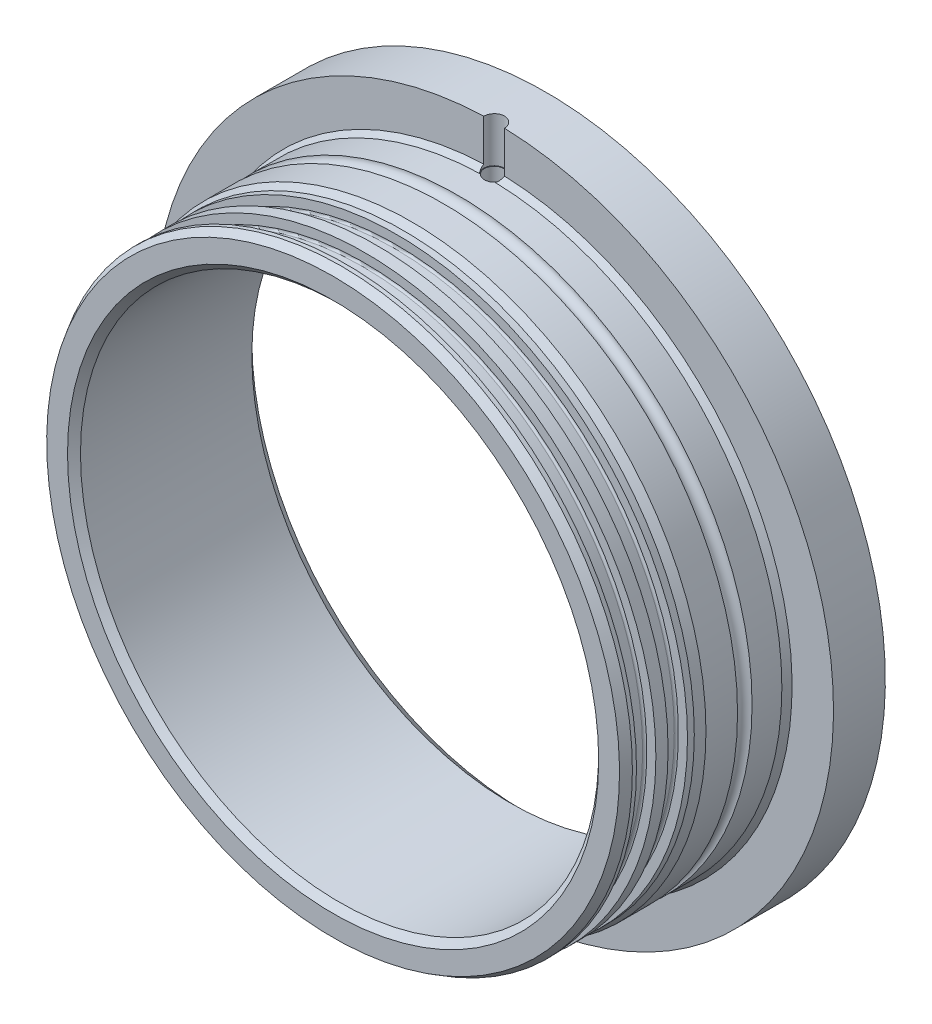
ISO-10303-21;
HEADER;
FILE_DESCRIPTION(('STEP AP214'),'2;1');
FILE_NAME('part.step','',(''),(''),'','','');
FILE_SCHEMA(('AUTOMOTIVE_DESIGN { 1 0 10303 214 1 1 1 1 }'));
ENDSEC;
DATA;
#1=APPLICATION_CONTEXT('core data for automotive mechanical design processes');
#2=APPLICATION_PROTOCOL_DEFINITION('international standard','automotive_design',2000,#1);
#3=PRODUCT_CONTEXT('',#1,'mechanical');
#4=PRODUCT('Part','Part','',(#3));
#5=PRODUCT_RELATED_PRODUCT_CATEGORY('part','',(#4));
#6=PRODUCT_DEFINITION_FORMATION('','',#4);
#7=PRODUCT_DEFINITION_CONTEXT('part definition',#1,'design');
#8=PRODUCT_DEFINITION('design','',#6,#7);
#9=PRODUCT_DEFINITION_SHAPE('','',#8);
#10=(LENGTH_UNIT() NAMED_UNIT(*) SI_UNIT(.MILLI.,.METRE.));
#11=(NAMED_UNIT(*) PLANE_ANGLE_UNIT() SI_UNIT($,.RADIAN.));
#12=(NAMED_UNIT(*) SI_UNIT($,.STERADIAN.) SOLID_ANGLE_UNIT());
#13=UNCERTAINTY_MEASURE_WITH_UNIT(LENGTH_MEASURE(1.E-05),#10,'distance_accuracy_value','');
#14=(GEOMETRIC_REPRESENTATION_CONTEXT(3) GLOBAL_UNCERTAINTY_ASSIGNED_CONTEXT((#13)) GLOBAL_UNIT_ASSIGNED_CONTEXT((#10,
#11,#12)) REPRESENTATION_CONTEXT('',''));
#15=CARTESIAN_POINT('',(0.,0.,0.));
#16=DIRECTION('',(0.,0.,1.));
#17=DIRECTION('',(1.,0.,0.));
#18=AXIS2_PLACEMENT_3D('',#15,#16,#17);
#19=CARTESIAN_POINT('',(0.,0.,27.4584));
#20=DIRECTION('',(0.,0.,-0.999999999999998));
#21=DIRECTION('',(-0.999999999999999,0.,0.));
#22=AXIS2_PLACEMENT_3D('',#19,#20,#21);
#23=CYLINDRICAL_SURFACE('',#22,63.5);
#24=CARTESIAN_POINT('',(0.,0.,25.8709));
#25=DIRECTION('',(0.,0.,-0.999999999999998));
#26=DIRECTION('',(-0.999999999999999,0.,0.));
#27=AXIS2_PLACEMENT_3D('',#24,#25,#26);
#28=CIRCLE('',#27,63.5);
#29=CARTESIAN_POINT('',(-63.4999999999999,0.,25.8709));
#30=VERTEX_POINT('',#29);
#31=EDGE_CURVE('E14',#30,#30,#28,.F.);
#32=CARTESIAN_POINT('',(0.,0.,-16.1206999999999));
#33=DIRECTION('',(0.,0.,-0.999999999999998));
#34=DIRECTION('',(-0.999999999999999,0.,0.));
#35=AXIS2_PLACEMENT_3D('',#32,#33,#34);
#36=CIRCLE('',#35,63.5);
#37=CARTESIAN_POINT('',(-63.4999999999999,0.,-16.1206999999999));
#38=VERTEX_POINT('',#37);
#39=EDGE_CURVE('E516',#38,#38,#36,.T.);
#40=CARTESIAN_POINT('',(-63.4999999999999,0.,25.8709));
#41=CARTESIAN_POINT('',(-63.4999999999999,0.,25.4334875));
#42=CARTESIAN_POINT('',(-63.4999999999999,0.,24.996075));
#43=CARTESIAN_POINT('',(-63.4999999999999,0.,24.12125));
#44=CARTESIAN_POINT('',(-63.4999999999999,0.,23.6838375));
#45=CARTESIAN_POINT('',(-63.4999999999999,0.,22.8090125));
#46=CARTESIAN_POINT('',(-63.4999999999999,0.,22.3716));
#47=CARTESIAN_POINT('',(-63.4999999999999,0.,21.496775));
#48=CARTESIAN_POINT('',(-63.4999999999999,0.,21.0593625));
#49=CARTESIAN_POINT('',(-63.4999999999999,0.,20.1845375));
#50=CARTESIAN_POINT('',(-63.4999999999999,0.,19.747125));
#51=CARTESIAN_POINT('',(-63.4999999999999,0.,18.8723));
#52=CARTESIAN_POINT('',(-63.4999999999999,0.,18.4348875));
#53=CARTESIAN_POINT('',(-63.4999999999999,0.,17.5600625));
#54=CARTESIAN_POINT('',(-63.4999999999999,0.,17.12265));
#55=CARTESIAN_POINT('',(-63.4999999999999,0.,16.247825));
#56=CARTESIAN_POINT('',(-63.4999999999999,0.,15.8104125));
#57=CARTESIAN_POINT('',(-63.4999999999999,0.,14.9355875));
#58=CARTESIAN_POINT('',(-63.4999999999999,0.,14.498175));
#59=CARTESIAN_POINT('',(-63.4999999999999,0.,13.62335));
#60=CARTESIAN_POINT('',(-63.4999999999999,0.,13.1859375));
#61=CARTESIAN_POINT('',(-63.4999999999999,0.,12.3111125));
#62=CARTESIAN_POINT('',(-63.4999999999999,0.,11.8737));
#63=CARTESIAN_POINT('',(-63.4999999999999,0.,10.998875));
#64=CARTESIAN_POINT('',(-63.4999999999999,0.,10.5614625));
#65=CARTESIAN_POINT('',(-63.4999999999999,0.,9.68663749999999));
#66=CARTESIAN_POINT('',(-63.4999999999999,0.,9.249225));
#67=CARTESIAN_POINT('',(-63.4999999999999,0.,8.3744));
#68=CARTESIAN_POINT('',(-63.4999999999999,0.,7.9369875));
#69=CARTESIAN_POINT('',(-63.4999999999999,0.,7.0621625));
#70=CARTESIAN_POINT('',(-63.4999999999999,0.,6.62475));
#71=CARTESIAN_POINT('',(-63.4999999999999,0.,5.74992500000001));
#72=CARTESIAN_POINT('',(-63.4999999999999,0.,5.31251250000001));
#73=CARTESIAN_POINT('',(-63.4999999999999,0.,4.43768750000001));
#74=CARTESIAN_POINT('',(-63.4999999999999,0.,4.00027500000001));
#75=CARTESIAN_POINT('',(-63.4999999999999,0.,3.12545000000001));
#76=CARTESIAN_POINT('',(-63.4999999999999,0.,2.68803750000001));
#77=CARTESIAN_POINT('',(-63.4999999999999,0.,1.81321250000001));
#78=CARTESIAN_POINT('',(-63.4999999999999,0.,1.37580000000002));
#79=CARTESIAN_POINT('',(-63.4999999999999,0.,0.500975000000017));
#80=CARTESIAN_POINT('',(-63.4999999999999,0.,0.0635625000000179));
#81=CARTESIAN_POINT('',(-63.4999999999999,0.,-0.81126249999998));
#82=CARTESIAN_POINT('',(-63.4999999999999,0.,-1.24867499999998));
#83=CARTESIAN_POINT('',(-63.4999999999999,0.,-2.12349999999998));
#84=CARTESIAN_POINT('',(-63.4999999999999,0.,-2.56091249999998));
#85=CARTESIAN_POINT('',(-63.4999999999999,0.,-3.43573749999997));
#86=CARTESIAN_POINT('',(-63.4999999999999,0.,-3.87314999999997));
#87=CARTESIAN_POINT('',(-63.4999999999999,0.,-4.74797499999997));
#88=CARTESIAN_POINT('',(-63.4999999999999,0.,-5.18538749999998));
#89=CARTESIAN_POINT('',(-63.4999999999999,0.,-6.06021249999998));
#90=CARTESIAN_POINT('',(-63.4999999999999,0.,-6.49762499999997));
#91=CARTESIAN_POINT('',(-63.4999999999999,0.,-7.37244999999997));
#92=CARTESIAN_POINT('',(-63.4999999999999,0.,-7.80986249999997));
#93=CARTESIAN_POINT('',(-63.4999999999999,0.,-8.68468749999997));
#94=CARTESIAN_POINT('',(-63.4999999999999,0.,-9.12209999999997));
#95=CARTESIAN_POINT('',(-63.4999999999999,0.,-9.99692499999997));
#96=CARTESIAN_POINT('',(-63.4999999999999,0.,-10.4343375));
#97=CARTESIAN_POINT('',(-63.4999999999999,0.,-11.3091625));
#98=CARTESIAN_POINT('',(-63.4999999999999,0.,-11.746575));
#99=CARTESIAN_POINT('',(-63.4999999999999,0.,-12.6214));
#100=CARTESIAN_POINT('',(-63.4999999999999,0.,-13.0588125));
#101=CARTESIAN_POINT('',(-63.4999999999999,0.,-13.9336375));
#102=CARTESIAN_POINT('',(-63.4999999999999,0.,-14.37105));
#103=CARTESIAN_POINT('',(-63.4999999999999,0.,-15.2458749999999));
#104=CARTESIAN_POINT('',(-63.4999999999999,0.,-15.6832874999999));
#105=CARTESIAN_POINT('',(-63.4999999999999,0.,-16.1206999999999));
#106=B_SPLINE_CURVE_WITH_KNOTS('',3,(#40,#41,#42,#43,#44,#45,#46,#47,#48,#49,#50,#51,#52,#53,
#54,#55,#56,#57,#58,#59,#60,#61,#62,#63,#64,#65,#66,#67,#68,#69,#70,#71,#72,#73,#74,#75,#76,#77,
#78,#79,#80,#81,#82,#83,#84,#85,#86,#87,#88,#89,#90,#91,#92,#93,#94,#95,#96,#97,#98,#99,#100,
#101,#102,#103,#104,#105),.UNSPECIFIED.,.F.,.F.,(4,2,2,2,2,2,2,2,2,2,2,2,2,2,2,2,2,2,2,2,2,2,2,
2,2,2,2,2,2,2,2,2,4),(0.,1.3122375,2.62447499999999,3.93671249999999,5.24894999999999,
6.56118749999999,7.87342499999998,9.18566249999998,10.4979,11.8101375,13.122375,14.4346125,
15.74685,17.0590875,18.371325,19.6835625,20.9957999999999,22.3080375,23.6202749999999,
24.9325124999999,26.2447499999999,27.5569874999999,28.8692249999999,30.1814624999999,
31.4936999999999,32.8059374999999,34.1181749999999,35.4304124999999,36.7426499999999,
38.0548874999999,39.3671249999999,40.6793624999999,41.9915999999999),.UNSPECIFIED.);
#107=EDGE_CURVE('BSEAM65',#30,#38,#106,.T.);
#108=ORIENTED_EDGE('',*,*,#31,.T.);
#109=ORIENTED_EDGE('',*,*,#39,.T.);
#110=ORIENTED_EDGE('',*,*,#107,.T.);
#111=ORIENTED_EDGE('',*,*,#107,.F.);
#112=EDGE_LOOP('',(#108,#110,#109,#111));
#113=FACE_BOUND('',#112,.T.);
#114=ADVANCED_FACE('F65',(#113),#23,.F.);
#115=CARTESIAN_POINT('',(0.,0.,0.));
#116=DIRECTION('',(0.,0.,0.999999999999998));
#117=DIRECTION('',(0.999999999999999,0.,0.));
#118=AXIS2_PLACEMENT_3D('',#115,#116,#117);
#119=CYLINDRICAL_SURFACE('',#118,72.112);
#120=CARTESIAN_POINT('',(0.,0.,0.452800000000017));
#121=DIRECTION('',(0.,0.,-0.999999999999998));
#122=DIRECTION('',(-0.999999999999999,0.,0.));
#123=AXIS2_PLACEMENT_3D('',#120,#121,#122);
#124=CIRCLE('',#123,72.112);
#125=CARTESIAN_POINT('',(72.1119999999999,0.,0.452800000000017));
#126=VERTEX_POINT('',#125);
#127=EDGE_CURVE('E525',#126,#126,#124,.T.);
#128=CARTESIAN_POINT('',(0.,0.,8.19680000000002));
#129=DIRECTION('',(0.,0.,0.999999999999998));
#130=DIRECTION('',(0.999999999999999,0.,0.));
#131=AXIS2_PLACEMENT_3D('',#128,#129,#130);
#132=CIRCLE('',#131,72.112);
#133=CARTESIAN_POINT('',(72.1119999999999,0.,8.19680000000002));
#134=VERTEX_POINT('',#133);
#135=EDGE_CURVE('E133',#134,#134,#132,.T.);
#136=CARTESIAN_POINT('',(72.1119999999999,0.,0.452800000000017));
#137=CARTESIAN_POINT('',(72.1119999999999,0.,0.533466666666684));
#138=CARTESIAN_POINT('',(72.1119999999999,0.,0.614133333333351));
#139=CARTESIAN_POINT('',(72.1119999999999,0.,0.775466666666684));
#140=CARTESIAN_POINT('',(72.1119999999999,0.,0.856133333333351));
#141=CARTESIAN_POINT('',(72.1119999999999,0.,1.01746666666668));
#142=CARTESIAN_POINT('',(72.1119999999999,0.,1.09813333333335));
#143=CARTESIAN_POINT('',(72.1119999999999,0.,1.25946666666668));
#144=CARTESIAN_POINT('',(72.1119999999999,0.,1.34013333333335));
#145=CARTESIAN_POINT('',(72.1119999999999,0.,1.50146666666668));
#146=CARTESIAN_POINT('',(72.1119999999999,0.,1.58213333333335));
#147=CARTESIAN_POINT('',(72.1119999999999,0.,1.74346666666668));
#148=CARTESIAN_POINT('',(72.1119999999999,0.,1.82413333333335));
#149=CARTESIAN_POINT('',(72.1119999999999,0.,1.98546666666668));
#150=CARTESIAN_POINT('',(72.1119999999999,0.,2.06613333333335));
#151=CARTESIAN_POINT('',(72.1119999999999,0.,2.22746666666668));
#152=CARTESIAN_POINT('',(72.1119999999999,0.,2.30813333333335));
#153=CARTESIAN_POINT('',(72.1119999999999,0.,2.46946666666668));
#154=CARTESIAN_POINT('',(72.1119999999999,0.,2.55013333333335));
#155=CARTESIAN_POINT('',(72.1119999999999,0.,2.71146666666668));
#156=CARTESIAN_POINT('',(72.1119999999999,0.,2.79213333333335));
#157=CARTESIAN_POINT('',(72.1119999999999,0.,2.95346666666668));
#158=CARTESIAN_POINT('',(72.1119999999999,0.,3.03413333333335));
#159=CARTESIAN_POINT('',(72.1119999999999,0.,3.19546666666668));
#160=CARTESIAN_POINT('',(72.1119999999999,0.,3.27613333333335));
#161=CARTESIAN_POINT('',(72.1119999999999,0.,3.43746666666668));
#162=CARTESIAN_POINT('',(72.1119999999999,0.,3.51813333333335));
#163=CARTESIAN_POINT('',(72.1119999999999,0.,3.67946666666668));
#164=CARTESIAN_POINT('',(72.1119999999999,0.,3.76013333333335));
#165=CARTESIAN_POINT('',(72.1119999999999,0.,3.92146666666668));
#166=CARTESIAN_POINT('',(72.1119999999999,0.,4.00213333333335));
#167=CARTESIAN_POINT('',(72.1119999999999,0.,4.16346666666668));
#168=CARTESIAN_POINT('',(72.1119999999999,0.,4.24413333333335));
#169=CARTESIAN_POINT('',(72.1119999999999,0.,4.40546666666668));
#170=CARTESIAN_POINT('',(72.1119999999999,0.,4.48613333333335));
#171=CARTESIAN_POINT('',(72.1119999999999,0.,4.64746666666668));
#172=CARTESIAN_POINT('',(72.1119999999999,0.,4.72813333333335));
#173=CARTESIAN_POINT('',(72.1119999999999,0.,4.88946666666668));
#174=CARTESIAN_POINT('',(72.1119999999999,0.,4.97013333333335));
#175=CARTESIAN_POINT('',(72.1119999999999,0.,5.13146666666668));
#176=CARTESIAN_POINT('',(72.1119999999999,0.,5.21213333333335));
#177=CARTESIAN_POINT('',(72.1119999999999,0.,5.37346666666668));
#178=CARTESIAN_POINT('',(72.1119999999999,0.,5.45413333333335));
#179=CARTESIAN_POINT('',(72.1119999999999,0.,5.61546666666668));
#180=CARTESIAN_POINT('',(72.1119999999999,0.,5.69613333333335));
#181=CARTESIAN_POINT('',(72.1119999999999,0.,5.85746666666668));
#182=CARTESIAN_POINT('',(72.1119999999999,0.,5.93813333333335));
#183=CARTESIAN_POINT('',(72.1119999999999,0.,6.09946666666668));
#184=CARTESIAN_POINT('',(72.1119999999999,0.,6.18013333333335));
#185=CARTESIAN_POINT('',(72.1119999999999,0.,6.34146666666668));
#186=CARTESIAN_POINT('',(72.1119999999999,0.,6.42213333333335));
#187=CARTESIAN_POINT('',(72.1119999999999,0.,6.58346666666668));
#188=CARTESIAN_POINT('',(72.1119999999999,0.,6.66413333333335));
#189=CARTESIAN_POINT('',(72.1119999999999,0.,6.82546666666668));
#190=CARTESIAN_POINT('',(72.1119999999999,0.,6.90613333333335));
#191=CARTESIAN_POINT('',(72.1119999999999,0.,7.06746666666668));
#192=CARTESIAN_POINT('',(72.1119999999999,0.,7.14813333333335));
#193=CARTESIAN_POINT('',(72.1119999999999,0.,7.30946666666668));
#194=CARTESIAN_POINT('',(72.1119999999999,0.,7.39013333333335));
#195=CARTESIAN_POINT('',(72.1119999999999,0.,7.55146666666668));
#196=CARTESIAN_POINT('',(72.1119999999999,0.,7.63213333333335));
#197=CARTESIAN_POINT('',(72.1119999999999,0.,7.79346666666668));
#198=CARTESIAN_POINT('',(72.1119999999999,0.,7.87413333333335));
#199=CARTESIAN_POINT('',(72.1119999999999,0.,8.03546666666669));
#200=CARTESIAN_POINT('',(72.1119999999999,0.,8.11613333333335));
#201=CARTESIAN_POINT('',(72.1119999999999,0.,8.19680000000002));
#202=B_SPLINE_CURVE_WITH_KNOTS('',3,(#136,#137,#138,#139,#140,#141,#142,#143,#144,#145,#146,
#147,#148,#149,#150,#151,#152,#153,#154,#155,#156,#157,#158,#159,#160,#161,#162,#163,#164,#165,
#166,#167,#168,#169,#170,#171,#172,#173,#174,#175,#176,#177,#178,#179,#180,#181,#182,#183,#184,
#185,#186,#187,#188,#189,#190,#191,#192,#193,#194,#195,#196,#197,#198,#199,#200,#201),
.UNSPECIFIED.,.F.,.F.,(4,2,2,2,2,2,2,2,2,2,2,2,2,2,2,2,2,2,2,2,2,2,2,2,2,2,2,2,2,2,2,2,4),(0.,
0.242,0.484,0.726,0.968,1.21,1.452,1.694,1.936,2.178,2.42,2.662,2.904,3.146,3.388,3.63,3.872,
4.114,4.356,4.598,4.84,5.082,5.324,5.566,5.808,6.05,6.292,6.534,6.776,7.018,7.26,7.502,7.744),.UNSPECIFIED.);
#203=EDGE_CURVE('BSEAM459',#126,#134,#202,.T.);
#204=ORIENTED_EDGE('',*,*,#127,.F.);
#205=ORIENTED_EDGE('',*,*,#135,.F.);
#206=ORIENTED_EDGE('',*,*,#203,.T.);
#207=ORIENTED_EDGE('',*,*,#203,.F.);
#208=EDGE_LOOP('',(#204,#206,#205,#207));
#209=FACE_BOUND('',#208,.T.);
#210=ADVANCED_FACE('F459',(#209),#119,.T.);
#211=CARTESIAN_POINT('',(0.,0.,-11.9932));
#212=DIRECTION('',(0.,0.,-0.999999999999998));
#213=DIRECTION('',(-0.999999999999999,0.,0.));
#214=AXIS2_PLACEMENT_3D('',#211,#212,#213);
#215=PLANE('',#214);
#216=DIRECTION('',(0.,-0.999999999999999,0.));
#217=VECTOR('',#216,1.);
#218=CARTESIAN_POINT('',(2.53999999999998,83.1850015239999,-11.9932));
#219=LINE('',#218,#217);
#220=CARTESIAN_POINT('',(2.53999999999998,72.9843584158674,-11.9932));
#221=VERTEX_POINT('',#220);
#222=CARTESIAN_POINT('',(2.53999999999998,83.1462138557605,-11.9932));
#223=VERTEX_POINT('',#222);
#224=EDGE_CURVE('E116',#221,#223,#219,.F.);
#225=ORIENTED_EDGE('',*,*,#224,.F.);
#226=CARTESIAN_POINT('',(0.,0.,-11.9932));
#227=DIRECTION('',(0.,0.,-0.999999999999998));
#228=DIRECTION('',(-0.999999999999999,0.,0.));
#229=AXIS2_PLACEMENT_3D('',#226,#227,#228);
#230=CIRCLE('',#229,73.0285435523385);
#231=CARTESIAN_POINT('',(-2.54000000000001,72.9843584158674,-11.9932));
#232=VERTEX_POINT('',#231);
#233=EDGE_CURVE('E127',#221,#232,#230,.T.);
#234=ORIENTED_EDGE('',*,*,#233,.T.);
#235=DIRECTION('',(0.,-0.999999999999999,0.));
#236=VECTOR('',#235,1.);
#237=CARTESIAN_POINT('',(-2.54000000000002,83.1850015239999,-11.9932));
#238=LINE('',#237,#236);
#239=CARTESIAN_POINT('',(-2.54000000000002,83.1462138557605,-11.9932));
#240=VERTEX_POINT('',#239);
#241=EDGE_CURVE('E114',#240,#232,#238,.T.);
#242=ORIENTED_EDGE('',*,*,#241,.F.);
#243=CARTESIAN_POINT('',(0.,0.,-11.9932));
#244=DIRECTION('',(0.,0.,-0.999999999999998));
#245=DIRECTION('',(-0.999999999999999,0.,0.));
#246=AXIS2_PLACEMENT_3D('',#243,#244,#245);
#247=CIRCLE('',#246,83.185001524);
#248=EDGE_CURVE('E125',#223,#240,#247,.T.);
#249=ORIENTED_EDGE('',*,*,#248,.F.);
#250=EDGE_LOOP('',(#225,#234,#242,#249));
#251=FACE_BOUND('',#250,.T.);
#252=ADVANCED_FACE('F124',(#251),#215,.F.);
#253=CARTESIAN_POINT('',(0.,0.,-24.6932));
#254=DIRECTION('',(0.,0.,0.999999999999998));
#255=DIRECTION('',(0.999999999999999,0.,0.));
#256=AXIS2_PLACEMENT_3D('',#253,#254,#255);
#257=CYLINDRICAL_SURFACE('',#256,83.185001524);
#258=CARTESIAN_POINT('',(0.,0.,-24.6932));
#259=DIRECTION('',(0.,0.,-0.999999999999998));
#260=DIRECTION('',(-0.999999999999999,0.,0.));
#261=AXIS2_PLACEMENT_3D('',#258,#259,#260);
#262=CIRCLE('',#261,83.185001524);
#263=CARTESIAN_POINT('',(-83.1850015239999,0.,-24.6932));
#264=VERTEX_POINT('',#263);
#265=EDGE_CURVE('E130',#264,#264,#262,.T.);
#266=ORIENTED_EDGE('',*,*,#265,.F.);
#267=EDGE_LOOP('',(#266));
#268=FACE_BOUND('',#267,.T.);
#269=CARTESIAN_POINT('',(2.53999999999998,83.1462138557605,-11.9932));
#270=CARTESIAN_POINT('',(2.54000686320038,83.1462129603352,-12.0646220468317));
#271=CARTESIAN_POINT('',(2.53698755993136,83.1463058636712,-12.1360408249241));
#272=CARTESIAN_POINT('',(2.52494973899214,83.1466726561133,-12.2783670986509));
#273=CARTESIAN_POINT('',(2.51593151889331,83.1469465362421,-12.3492746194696));
#274=CARTESIAN_POINT('',(2.49195762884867,83.1476684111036,-12.4900299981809));
#275=CARTESIAN_POINT('',(2.47700624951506,83.14811628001,-12.5598785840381));
#276=CARTESIAN_POINT('',(2.44128759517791,83.1491726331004,-12.6980502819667));
#277=CARTESIAN_POINT('',(2.42052038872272,83.1497811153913,-12.7663734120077));
#278=CARTESIAN_POINT('',(2.34966439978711,83.1518239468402,-12.9683922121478));
#279=CARTESIAN_POINT('',(2.29101083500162,83.1534760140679,-13.099198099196));
#280=CARTESIAN_POINT('',(2.15262596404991,83.1571730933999,-13.349008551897));
#281=CARTESIAN_POINT('',(2.07289864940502,83.1592180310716,-13.46801534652));
#282=CARTESIAN_POINT('',(1.89457075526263,83.1634716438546,-13.6910155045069));
#283=CARTESIAN_POINT('',(1.79596428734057,83.1656803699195,-13.7950041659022));
#284=CARTESIAN_POINT('',(1.58268002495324,83.1700123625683,-13.9849644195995));
#285=CARTESIAN_POINT('',(1.46799978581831,83.1721356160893,-14.0709332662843));
#286=CARTESIAN_POINT('',(1.22581097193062,83.1760573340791,-14.2224127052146));
#287=CARTESIAN_POINT('',(1.09830045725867,83.1778557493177,-14.2879201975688));
#288=CARTESIAN_POINT('',(0.834093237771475,83.1809245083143,-14.3965916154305));
#289=CARTESIAN_POINT('',(0.697397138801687,83.18219488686,-14.4397570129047));
#290=CARTESIAN_POINT('',(0.418734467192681,83.184064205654,-14.5025132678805));
#291=CARTESIAN_POINT('',(0.276769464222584,83.18466334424,-14.5221110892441));
#292=CARTESIAN_POINT('',(-0.00844012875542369,83.1851233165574,-14.5371972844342));
#293=CARTESIAN_POINT('',(-0.15168474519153,83.1849841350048,-14.532685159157));
#294=CARTESIAN_POINT('',(-0.435332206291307,83.1839832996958,-14.4996846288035));
#295=CARTESIAN_POINT('',(-0.57573601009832,83.1831218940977,-14.4712044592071));
#296=CARTESIAN_POINT('',(-0.84976812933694,83.1807739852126,-14.3910890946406));
#297=CARTESIAN_POINT('',(-0.983396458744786,83.179287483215,-14.339453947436));
#298=CARTESIAN_POINT('',(-1.24011415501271,83.1758564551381,-14.2144837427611));
#299=CARTESIAN_POINT('',(-1.36320145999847,83.1739118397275,-14.1411444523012));
#300=CARTESIAN_POINT('',(-1.59531380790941,83.169783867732,-13.9748544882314));
#301=CARTESIAN_POINT('',(-1.70433949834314,83.1676005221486,-13.8819047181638));
#302=CARTESIAN_POINT('',(-1.90527390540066,83.1632402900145,-13.6790009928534));
#303=CARTESIAN_POINT('',(-1.99717791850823,83.1610634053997,-13.5690423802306));
#304=CARTESIAN_POINT('',(-2.16125155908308,83.1569614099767,-13.3352103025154));
#305=CARTESIAN_POINT('',(-2.2334149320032,83.1550363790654,-13.2113324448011));
#306=CARTESIAN_POINT('',(-2.35595471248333,83.1516550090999,-12.9531599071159));
#307=CARTESIAN_POINT('',(-2.40631765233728,83.1501989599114,-12.8188588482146));
#308=CARTESIAN_POINT('',(-2.483702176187,83.1479237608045,-12.5438064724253));
#309=CARTESIAN_POINT('',(-2.51075937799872,83.1471036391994,-12.4030653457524));
#310=CARTESIAN_POINT('',(-2.53054798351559,83.1465021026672,-12.2166870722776));
#311=CARTESIAN_POINT('',(-2.53409435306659,83.1463940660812,-12.172023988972));
#312=CARTESIAN_POINT('',(-2.5388171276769,83.1462500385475,-12.082646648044));
#313=CARTESIAN_POINT('',(-2.53999744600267,83.1462139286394,-12.0379325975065));
#314=CARTESIAN_POINT('',(-2.54000000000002,83.1462138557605,-11.9932));
#315=B_SPLINE_CURVE_WITH_KNOTS('',3,(#269,#270,#271,#272,#273,#274,#275,#276,#277,#278,#279,
#280,#281,#282,#283,#284,#285,#286,#287,#288,#289,#290,#291,#292,#293,#294,#295,#296,#297,#298,
#299,#300,#301,#302,#303,#304,#305,#306,#307,#308,#309,#310,#311,#312,#313,#314),.UNSPECIFIED.,
.F.,.F.,(4,2,2,2,2,2,2,2,2,2,2,2,2,2,2,2,2,2,2,2,2,2,4),(0.,0.214196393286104,0.428382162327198,
0.64241332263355,0.85644196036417,1.28431648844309,1.71211003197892,2.14003722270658,
2.56802956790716,2.99608672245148,3.42411567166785,3.85201811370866,4.27992941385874,
4.7076937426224,5.13545718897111,5.56330411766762,5.99113133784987,6.41907591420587,
6.8471559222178,7.27550001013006,7.70318829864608,7.83755583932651,7.97170096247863),.UNSPECIFIED.);
#316=EDGE_CURVE('E111',#223,#240,#315,.T.);
#317=ORIENTED_EDGE('',*,*,#316,.F.);
#318=ORIENTED_EDGE('',*,*,#248,.T.);
#319=EDGE_LOOP('',(#317,#318));
#320=FACE_BOUND('',#319,.T.);
#321=ADVANCED_FACE('F129',(#268,#320),#257,.T.);
#322=CARTESIAN_POINT('',(0.,0.,0.));
#323=DIRECTION('',(0.,0.,0.999999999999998));
#324=DIRECTION('',(0.999999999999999,0.,0.));
#325=AXIS2_PLACEMENT_3D('',#322,#323,#324);
#326=CYLINDRICAL_SURFACE('',#325,71.35);
#327=CARTESIAN_POINT('',(0.,0.,11.9588));
#328=DIRECTION('',(0.,0.,0.999999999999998));
#329=DIRECTION('',(0.999999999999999,0.,0.));
#330=AXIS2_PLACEMENT_3D('',#327,#328,#329);
#331=CIRCLE('',#330,71.35);
#332=CARTESIAN_POINT('',(71.3499999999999,0.,11.9588));
#333=VERTEX_POINT('',#332);
#334=EDGE_CURVE('E147',#333,#333,#331,.F.);
#335=CARTESIAN_POINT('',(0.,0.,10.2903777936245));
#336=DIRECTION('',(0.,0.,0.999999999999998));
#337=DIRECTION('',(0.999999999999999,0.,0.));
#338=AXIS2_PLACEMENT_3D('',#335,#336,#337);
#339=CIRCLE('',#338,71.35);
#340=CARTESIAN_POINT('',(71.3499999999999,0.,10.2903777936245));
#341=VERTEX_POINT('',#340);
#342=EDGE_CURVE('E139',#341,#341,#339,.T.);
#343=CARTESIAN_POINT('',(71.3499999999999,0.,11.9588));
#344=CARTESIAN_POINT('',(71.3499999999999,0.,11.9414206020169));
#345=CARTESIAN_POINT('',(71.3499999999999,0.,11.9240412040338));
#346=CARTESIAN_POINT('',(71.3499999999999,0.,11.8892824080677));
#347=CARTESIAN_POINT('',(71.3499999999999,0.,11.8719030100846));
#348=CARTESIAN_POINT('',(71.3499999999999,0.,11.8371442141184));
#349=CARTESIAN_POINT('',(71.3499999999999,0.,11.8197648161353));
#350=CARTESIAN_POINT('',(71.3499999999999,0.,11.7850060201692));
#351=CARTESIAN_POINT('',(71.3499999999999,0.,11.7676266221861));
#352=CARTESIAN_POINT('',(71.3499999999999,0.,11.73286782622));
#353=CARTESIAN_POINT('',(71.3499999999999,0.,11.7154884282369));
#354=CARTESIAN_POINT('',(71.3499999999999,0.,11.6807296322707));
#355=CARTESIAN_POINT('',(71.3499999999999,0.,11.6633502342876));
#356=CARTESIAN_POINT('',(71.3499999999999,0.,11.6285914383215));
#357=CARTESIAN_POINT('',(71.3499999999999,0.,11.6112120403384));
#358=CARTESIAN_POINT('',(71.3499999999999,0.,11.5764532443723));
#359=CARTESIAN_POINT('',(71.3499999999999,0.,11.5590738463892));
#360=CARTESIAN_POINT('',(71.3499999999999,0.,11.524315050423));
#361=CARTESIAN_POINT('',(71.3499999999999,0.,11.5069356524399));
#362=CARTESIAN_POINT('',(71.3499999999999,0.,11.4721768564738));
#363=CARTESIAN_POINT('',(71.3499999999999,0.,11.4547974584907));
#364=CARTESIAN_POINT('',(71.3499999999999,0.,11.4200386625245));
#365=CARTESIAN_POINT('',(71.3499999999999,0.,11.4026592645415));
#366=CARTESIAN_POINT('',(71.3499999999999,0.,11.3679004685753));
#367=CARTESIAN_POINT('',(71.3499999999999,0.,11.3505210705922));
#368=CARTESIAN_POINT('',(71.3499999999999,0.,11.3157622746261));
#369=CARTESIAN_POINT('',(71.3499999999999,0.,11.298382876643));
#370=CARTESIAN_POINT('',(71.3499999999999,0.,11.2636240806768));
#371=CARTESIAN_POINT('',(71.3499999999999,0.,11.2462446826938));
#372=CARTESIAN_POINT('',(71.3499999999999,0.,11.2114858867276));
#373=CARTESIAN_POINT('',(71.3499999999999,0.,11.1941064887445));
#374=CARTESIAN_POINT('',(71.3499999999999,0.,11.1593476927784));
#375=CARTESIAN_POINT('',(71.3499999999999,0.,11.1419682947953));
#376=CARTESIAN_POINT('',(71.3499999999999,0.,11.1072094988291));
#377=CARTESIAN_POINT('',(71.3499999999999,0.,11.0898301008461));
#378=CARTESIAN_POINT('',(71.3499999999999,0.,11.0550713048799));
#379=CARTESIAN_POINT('',(71.3499999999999,0.,11.0376919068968));
#380=CARTESIAN_POINT('',(71.3499999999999,0.,11.0029331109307));
#381=CARTESIAN_POINT('',(71.3499999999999,0.,10.9855537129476));
#382=CARTESIAN_POINT('',(71.3499999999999,0.,10.9507949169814));
#383=CARTESIAN_POINT('',(71.3499999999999,0.,10.9334155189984));
#384=CARTESIAN_POINT('',(71.3499999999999,0.,10.8986567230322));
#385=CARTESIAN_POINT('',(71.3499999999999,0.,10.8812773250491));
#386=CARTESIAN_POINT('',(71.3499999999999,0.,10.846518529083));
#387=CARTESIAN_POINT('',(71.3499999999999,0.,10.8291391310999));
#388=CARTESIAN_POINT('',(71.3499999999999,0.,10.7943803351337));
#389=CARTESIAN_POINT('',(71.3499999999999,0.,10.7770009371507));
#390=CARTESIAN_POINT('',(71.3499999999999,0.,10.7422421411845));
#391=CARTESIAN_POINT('',(71.3499999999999,0.,10.7248627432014));
#392=CARTESIAN_POINT('',(71.3499999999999,0.,10.6901039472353));
#393=CARTESIAN_POINT('',(71.3499999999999,0.,10.6727245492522));
#394=CARTESIAN_POINT('',(71.3499999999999,0.,10.637965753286));
#395=CARTESIAN_POINT('',(71.3499999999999,0.,10.620586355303));
#396=CARTESIAN_POINT('',(71.3499999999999,0.,10.5858275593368));
#397=CARTESIAN_POINT('',(71.3499999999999,0.,10.5684481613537));
#398=CARTESIAN_POINT('',(71.3499999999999,0.,10.5336893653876));
#399=CARTESIAN_POINT('',(71.3499999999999,0.,10.5163099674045));
#400=CARTESIAN_POINT('',(71.3499999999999,0.,10.4815511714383));
#401=CARTESIAN_POINT('',(71.3499999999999,0.,10.4641717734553));
#402=CARTESIAN_POINT('',(71.3499999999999,0.,10.4294129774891));
#403=CARTESIAN_POINT('',(71.3499999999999,0.,10.412033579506));
#404=CARTESIAN_POINT('',(71.3499999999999,0.,10.3772747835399));
#405=CARTESIAN_POINT('',(71.3499999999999,0.,10.3598953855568));
#406=CARTESIAN_POINT('',(71.3499999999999,0.,10.3251365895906));
#407=CARTESIAN_POINT('',(71.3499999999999,0.,10.3077571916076));
#408=CARTESIAN_POINT('',(71.3499999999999,0.,10.2903777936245));
#409=B_SPLINE_CURVE_WITH_KNOTS('',3,(#343,#344,#345,#346,#347,#348,#349,#350,#351,#352,#353,
#354,#355,#356,#357,#358,#359,#360,#361,#362,#363,#364,#365,#366,#367,#368,#369,#370,#371,#372,
#373,#374,#375,#376,#377,#378,#379,#380,#381,#382,#383,#384,#385,#386,#387,#388,#389,#390,#391,
#392,#393,#394,#395,#396,#397,#398,#399,#400,#401,#402,#403,#404,#405,#406,#407,#408),
.UNSPECIFIED.,.F.,.F.,(4,2,2,2,2,2,2,2,2,2,2,2,2,2,2,2,2,2,2,2,2,2,2,2,2,2,2,2,2,2,2,2,4),(0.,
0.0521381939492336,0.104276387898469,0.156414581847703,0.208552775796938,0.260690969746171,
0.312829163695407,0.36496735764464,0.417105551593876,0.469243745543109,0.521381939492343,
0.573520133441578,0.625658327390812,0.677796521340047,0.729934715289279,0.782072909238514,
0.834211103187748,0.886349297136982,0.938487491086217,0.99062568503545,1.04276387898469,
1.09490207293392,1.14704026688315,1.19917846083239,1.25131665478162,1.30345484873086,
1.35559304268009,1.40773123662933,1.45986943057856,1.5120076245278,1.56414581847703,
1.61628401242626,1.6684222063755),.UNSPECIFIED.);
#410=EDGE_CURVE('BSEAM475',#333,#341,#409,.T.);
#411=ORIENTED_EDGE('',*,*,#334,.T.);
#412=ORIENTED_EDGE('',*,*,#342,.T.);
#413=ORIENTED_EDGE('',*,*,#410,.T.);
#414=ORIENTED_EDGE('',*,*,#410,.F.);
#415=EDGE_LOOP('',(#411,#413,#412,#414));
#416=FACE_BOUND('',#415,.T.);
#417=ADVANCED_FACE('F475',(#416),#326,.T.);
#418=CARTESIAN_POINT('',(0.,71.3499999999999,27.4584));
#419=DIRECTION('',(0.,0.,-0.999999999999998));
#420=DIRECTION('',(-0.999999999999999,0.,0.));
#421=AXIS2_PLACEMENT_3D('',#418,#419,#420);
#422=PLANE('',#421);
#423=CARTESIAN_POINT('',(0.,0.,27.4584));
#424=DIRECTION('',(0.,0.,-0.999999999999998));
#425=DIRECTION('',(-0.999999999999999,0.,0.));
#426=AXIS2_PLACEMENT_3D('',#423,#424,#425);
#427=CIRCLE('',#426,65.0875);
#428=CARTESIAN_POINT('',(-65.0874999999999,0.,27.4584));
#429=VERTEX_POINT('',#428);
#430=EDGE_CURVE('E73',#429,#429,#427,.T.);
#431=ORIENTED_EDGE('',*,*,#430,.T.);
#432=EDGE_LOOP('',(#431));
#433=FACE_BOUND('',#432,.T.);
#434=CARTESIAN_POINT('',(0.,0.,27.4584));
#435=DIRECTION('',(0.,0.,-0.999999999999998));
#436=DIRECTION('',(0.,0.999999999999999,0.));
#437=AXIS2_PLACEMENT_3D('',#434,#435,#436);
#438=CIRCLE('',#437,70.1952994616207);
#439=CARTESIAN_POINT('',(0.,70.1952994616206,27.4584));
#440=VERTEX_POINT('',#439);
#441=EDGE_CURVE('E142',#440,#440,#438,.T.);
#442=ORIENTED_EDGE('',*,*,#441,.F.);
#443=EDGE_LOOP('',(#442));
#444=FACE_BOUND('',#443,.T.);
#445=ADVANCED_FACE('F448',(#433,#444),#422,.F.);
#446=CARTESIAN_POINT('',(0.,0.,25.4583999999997));
#447=DIRECTION('',(0.,0.,-0.999999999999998));
#448=DIRECTION('',(0.,0.999999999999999,0.));
#449=AXIS2_PLACEMENT_3D('',#446,#447,#448);
#450=CONICAL_SURFACE('',#449,71.35,0.523598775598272);
#451=CARTESIAN_POINT('',(0.,0.,25.4583999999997));
#452=DIRECTION('',(0.,0.,0.999999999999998));
#453=DIRECTION('',(0.999999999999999,0.,0.));
#454=AXIS2_PLACEMENT_3D('',#451,#452,#453);
#455=CIRCLE('',#454,71.35);
#456=CARTESIAN_POINT('',(0.,71.3499999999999,25.4583999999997));
#457=VERTEX_POINT('',#456);
#458=EDGE_CURVE('E143',#457,#457,#455,.F.);
#459=CARTESIAN_POINT('',(0.,71.3499999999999,25.4583999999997));
#460=CARTESIAN_POINT('',(0.,71.3379718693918,25.4792333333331));
#461=CARTESIAN_POINT('',(0.,71.3259437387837,25.5000666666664));
#462=CARTESIAN_POINT('',(0.,71.3018874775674,25.5417333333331));
#463=CARTESIAN_POINT('',(0.,71.2898593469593,25.5625666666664));
#464=CARTESIAN_POINT('',(0.,71.2658030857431,25.6042333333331));
#465=CARTESIAN_POINT('',(0.,71.253774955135,25.6250666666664));
#466=CARTESIAN_POINT('',(0.,71.2297186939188,25.6667333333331));
#467=CARTESIAN_POINT('',(0.,71.2176905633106,25.6875666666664));
#468=CARTESIAN_POINT('',(0.,71.1936343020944,25.7292333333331));
#469=CARTESIAN_POINT('',(0.,71.1816061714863,25.7500666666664));
#470=CARTESIAN_POINT('',(0.,71.15754991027,25.7917333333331));
#471=CARTESIAN_POINT('',(0.,71.1455217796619,25.8125666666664));
#472=CARTESIAN_POINT('',(0.,71.1214655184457,25.8542333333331));
#473=CARTESIAN_POINT('',(0.,71.1094373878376,25.8750666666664));
#474=CARTESIAN_POINT('',(0.,71.0853811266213,25.9167333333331));
#475=CARTESIAN_POINT('',(0.,71.0733529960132,25.9375666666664));
#476=CARTESIAN_POINT('',(0.,71.049296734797,25.9792333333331));
#477=CARTESIAN_POINT('',(0.,71.0372686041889,26.0000666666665));
#478=CARTESIAN_POINT('',(0.,71.0132123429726,26.0417333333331));
#479=CARTESIAN_POINT('',(0.,71.0011842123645,26.0625666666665));
#480=CARTESIAN_POINT('',(0.,70.9771279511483,26.1042333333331));
#481=CARTESIAN_POINT('',(0.,70.9650998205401,26.1250666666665));
#482=CARTESIAN_POINT('',(0.,70.9410435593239,26.1667333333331));
#483=CARTESIAN_POINT('',(0.,70.9290154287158,26.1875666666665));
#484=CARTESIAN_POINT('',(0.,70.9049591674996,26.2292333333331));
#485=CARTESIAN_POINT('',(0.,70.8929310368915,26.2500666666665));
#486=CARTESIAN_POINT('',(0.,70.8688747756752,26.2917333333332));
#487=CARTESIAN_POINT('',(0.,70.8568466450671,26.3125666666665));
#488=CARTESIAN_POINT('',(0.,70.8327903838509,26.3542333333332));
#489=CARTESIAN_POINT('',(0.,70.8207622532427,26.3750666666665));
#490=CARTESIAN_POINT('',(0.,70.7967059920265,26.4167333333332));
#491=CARTESIAN_POINT('',(0.,70.7846778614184,26.4375666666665));
#492=CARTESIAN_POINT('',(0.,70.7606216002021,26.4792333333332));
#493=CARTESIAN_POINT('',(0.,70.748593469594,26.5000666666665));
#494=CARTESIAN_POINT('',(0.,70.7245372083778,26.5417333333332));
#495=CARTESIAN_POINT('',(0.,70.7125090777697,26.5625666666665));
#496=CARTESIAN_POINT('',(0.,70.6884528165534,26.6042333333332));
#497=CARTESIAN_POINT('',(0.,70.6764246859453,26.6250666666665));
#498=CARTESIAN_POINT('',(0.,70.6523684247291,26.6667333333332));
#499=CARTESIAN_POINT('',(0.,70.640340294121,26.6875666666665));
#500=CARTESIAN_POINT('',(0.,70.6162840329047,26.7292333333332));
#501=CARTESIAN_POINT('',(0.,70.6042559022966,26.7500666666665));
#502=CARTESIAN_POINT('',(0.,70.5801996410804,26.7917333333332));
#503=CARTESIAN_POINT('',(0.,70.5681715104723,26.8125666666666));
#504=CARTESIAN_POINT('',(0.,70.544115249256,26.8542333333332));
#505=CARTESIAN_POINT('',(0.,70.5320871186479,26.8750666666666));
#506=CARTESIAN_POINT('',(0.,70.5080308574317,26.9167333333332));
#507=CARTESIAN_POINT('',(0.,70.4960027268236,26.9375666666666));
#508=CARTESIAN_POINT('',(0.,70.4719464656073,26.9792333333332));
#509=CARTESIAN_POINT('',(0.,70.4599183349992,27.0000666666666));
#510=CARTESIAN_POINT('',(0.,70.435862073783,27.0417333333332));
#511=CARTESIAN_POINT('',(0.,70.4238339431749,27.0625666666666));
#512=CARTESIAN_POINT('',(0.,70.3997776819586,27.1042333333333));
#513=CARTESIAN_POINT('',(0.,70.3877495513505,27.1250666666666));
#514=CARTESIAN_POINT('',(0.,70.3636932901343,27.1667333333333));
#515=CARTESIAN_POINT('',(0.,70.3516651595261,27.1875666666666));
#516=CARTESIAN_POINT('',(0.,70.3276088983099,27.2292333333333));
#517=CARTESIAN_POINT('',(0.,70.3155807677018,27.2500666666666));
#518=CARTESIAN_POINT('',(0.,70.2915245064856,27.2917333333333));
#519=CARTESIAN_POINT('',(0.,70.2794963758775,27.3125666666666));
#520=CARTESIAN_POINT('',(0.,70.2554401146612,27.3542333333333));
#521=CARTESIAN_POINT('',(0.,70.2434119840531,27.3750666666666));
#522=CARTESIAN_POINT('',(0.,70.2193557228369,27.4167333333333));
#523=CARTESIAN_POINT('',(0.,70.2073275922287,27.4375666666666));
#524=CARTESIAN_POINT('',(0.,70.1952994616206,27.4584));
#525=B_SPLINE_CURVE_WITH_KNOTS('',3,(#459,#460,#461,#462,#463,#464,#465,#466,#467,#468,#469,
#470,#471,#472,#473,#474,#475,#476,#477,#478,#479,#480,#481,#482,#483,#484,#485,#486,#487,#488,
#489,#490,#491,#492,#493,#494,#495,#496,#497,#498,#499,#500,#501,#502,#503,#504,#505,#506,#507,
#508,#509,#510,#511,#512,#513,#514,#515,#516,#517,#518,#519,#520,#521,#522,#523,#524),
.UNSPECIFIED.,.F.,.F.,(4,2,2,2,2,2,2,2,2,2,2,2,2,2,2,2,2,2,2,2,2,2,2,2,2,2,2,2,2,2,2,2,4),(0.,
0.0721687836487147,0.144337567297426,0.216506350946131,0.288675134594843,0.360843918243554,
0.433012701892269,0.505181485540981,0.577350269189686,0.649519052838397,0.721687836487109,
0.793856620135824,0.866025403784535,0.93819418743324,1.01036297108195,1.08253175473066,
1.15470053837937,1.22686932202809,1.2990381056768,1.37120688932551,1.44337567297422,
1.51554445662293,1.58771324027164,1.65988202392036,1.73205080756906,1.80421959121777,
1.87638837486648,1.9485571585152,2.02072594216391,2.09289472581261,2.16506350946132,
2.23723229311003,2.30940107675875),.UNSPECIFIED.);
#526=EDGE_CURVE('BSEAM644',#457,#440,#525,.T.);
#527=ORIENTED_EDGE('',*,*,#458,.F.);
#528=ORIENTED_EDGE('',*,*,#441,.T.);
#529=ORIENTED_EDGE('',*,*,#526,.T.);
#530=ORIENTED_EDGE('',*,*,#526,.F.);
#531=EDGE_LOOP('',(#527,#529,#528,#530));
#532=FACE_BOUND('',#531,.T.);
#533=ADVANCED_FACE('F644',(#532),#450,.T.);
#534=CARTESIAN_POINT('',(0.,0.,0.));
#535=DIRECTION('',(0.,0.,0.999999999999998));
#536=DIRECTION('',(0.999999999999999,0.,0.));
#537=AXIS2_PLACEMENT_3D('',#534,#535,#536);
#538=CYLINDRICAL_SURFACE('',#537,71.35);
#539=ORIENTED_EDGE('',*,*,#458,.T.);
#540=EDGE_LOOP('',(#539));
#541=FACE_BOUND('',#540,.T.);
#542=CARTESIAN_POINT('',(0.,0.,24.4584));
#543=DIRECTION('',(0.,0.,0.999999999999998));
#544=DIRECTION('',(0.999999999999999,0.,0.));
#545=AXIS2_PLACEMENT_3D('',#542,#543,#544);
#546=CIRCLE('',#545,71.35);
#547=CARTESIAN_POINT('',(71.3499999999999,0.,24.4584));
#548=VERTEX_POINT('',#547);
#549=EDGE_CURVE('E146',#548,#548,#546,.T.);
#550=ORIENTED_EDGE('',*,*,#549,.T.);
#551=EDGE_LOOP('',(#550));
#552=FACE_BOUND('',#551,.T.);
#553=ADVANCED_FACE('F636',(#541,#552),#538,.T.);
#554=CARTESIAN_POINT('',(0.,68.6180999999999,24.4584));
#555=DIRECTION('',(0.,0.,0.999999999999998));
#556=DIRECTION('',(0.999999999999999,0.,0.));
#557=AXIS2_PLACEMENT_3D('',#554,#555,#556);
#558=PLANE('',#557);
#559=CARTESIAN_POINT('',(0.,0.,24.4584));
#560=DIRECTION('',(0.,0.,0.999999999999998));
#561=DIRECTION('',(0.999999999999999,0.,0.));
#562=AXIS2_PLACEMENT_3D('',#559,#560,#561);
#563=CIRCLE('',#562,69.1261);
#564=CARTESIAN_POINT('',(69.1260999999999,0.,24.4584));
#565=VERTEX_POINT('',#564);
#566=EDGE_CURVE('E120',#565,#565,#563,.T.);
#567=ORIENTED_EDGE('',*,*,#566,.T.);
#568=EDGE_LOOP('',(#567));
#569=FACE_BOUND('',#568,.T.);
#570=ORIENTED_EDGE('',*,*,#549,.F.);
#571=EDGE_LOOP('',(#570));
#572=FACE_BOUND('',#571,.T.);
#573=ADVANCED_FACE('F628',(#569,#572),#558,.F.);
#574=CARTESIAN_POINT('',(0.,0.,0.));
#575=DIRECTION('',(0.,0.,0.999999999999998));
#576=DIRECTION('',(0.999999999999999,0.,0.));
#577=AXIS2_PLACEMENT_3D('',#574,#575,#576);
#578=CYLINDRICAL_SURFACE('',#577,68.6181);
#579=CARTESIAN_POINT('',(0.,0.,20.2166));
#580=DIRECTION('',(0.,0.,-0.999999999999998));
#581=DIRECTION('',(-0.999999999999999,0.,0.));
#582=AXIS2_PLACEMENT_3D('',#579,#580,#581);
#583=CIRCLE('',#582,68.6181);
#584=CARTESIAN_POINT('',(68.6180999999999,0.,20.2166));
#585=VERTEX_POINT('',#584);
#586=EDGE_CURVE('E364',#585,#585,#583,.F.);
#587=CARTESIAN_POINT('',(0.,0.,23.9504));
#588=DIRECTION('',(0.,0.,0.999999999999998));
#589=DIRECTION('',(0.999999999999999,0.,0.));
#590=AXIS2_PLACEMENT_3D('',#587,#588,#589);
#591=CIRCLE('',#590,68.6181);
#592=CARTESIAN_POINT('',(68.6180999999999,0.,23.9504));
#593=VERTEX_POINT('',#592);
#594=EDGE_CURVE('E361',#593,#593,#591,.F.);
#595=CARTESIAN_POINT('',(68.6180999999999,0.,20.2166));
#596=CARTESIAN_POINT('',(68.6180999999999,0.,20.25549375));
#597=CARTESIAN_POINT('',(68.6180999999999,0.,20.2943875));
#598=CARTESIAN_POINT('',(68.6180999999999,0.,20.372175));
#599=CARTESIAN_POINT('',(68.6180999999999,0.,20.41106875));
#600=CARTESIAN_POINT('',(68.6180999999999,0.,20.48885625));
#601=CARTESIAN_POINT('',(68.6180999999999,0.,20.52775));
#602=CARTESIAN_POINT('',(68.6180999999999,0.,20.6055375));
#603=CARTESIAN_POINT('',(68.6180999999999,0.,20.64443125));
#604=CARTESIAN_POINT('',(68.6180999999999,0.,20.72221875));
#605=CARTESIAN_POINT('',(68.6180999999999,0.,20.7611125));
#606=CARTESIAN_POINT('',(68.6180999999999,0.,20.8389));
#607=CARTESIAN_POINT('',(68.6180999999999,0.,20.87779375));
#608=CARTESIAN_POINT('',(68.6180999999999,0.,20.95558125));
#609=CARTESIAN_POINT('',(68.6180999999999,0.,20.994475));
#610=CARTESIAN_POINT('',(68.6180999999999,0.,21.0722625));
#611=CARTESIAN_POINT('',(68.6180999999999,0.,21.11115625));
#612=CARTESIAN_POINT('',(68.6180999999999,0.,21.18894375));
#613=CARTESIAN_POINT('',(68.6180999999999,0.,21.2278375));
#614=CARTESIAN_POINT('',(68.6180999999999,0.,21.305625));
#615=CARTESIAN_POINT('',(68.6180999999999,0.,21.34451875));
#616=CARTESIAN_POINT('',(68.6180999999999,0.,21.42230625));
#617=CARTESIAN_POINT('',(68.6180999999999,0.,21.4612));
#618=CARTESIAN_POINT('',(68.6180999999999,0.,21.5389875));
#619=CARTESIAN_POINT('',(68.6180999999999,0.,21.57788125));
#620=CARTESIAN_POINT('',(68.6180999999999,0.,21.65566875));
#621=CARTESIAN_POINT('',(68.6180999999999,0.,21.6945625));
#622=CARTESIAN_POINT('',(68.6180999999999,0.,21.77235));
#623=CARTESIAN_POINT('',(68.6180999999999,0.,21.81124375));
#624=CARTESIAN_POINT('',(68.6180999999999,0.,21.88903125));
#625=CARTESIAN_POINT('',(68.6180999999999,0.,21.927925));
#626=CARTESIAN_POINT('',(68.6180999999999,0.,22.0057125));
#627=CARTESIAN_POINT('',(68.6180999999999,0.,22.04460625));
#628=CARTESIAN_POINT('',(68.6180999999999,0.,22.12239375));
#629=CARTESIAN_POINT('',(68.6180999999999,0.,22.1612875));
#630=CARTESIAN_POINT('',(68.6180999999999,0.,22.239075));
#631=CARTESIAN_POINT('',(68.6180999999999,0.,22.27796875));
#632=CARTESIAN_POINT('',(68.6180999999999,0.,22.35575625));
#633=CARTESIAN_POINT('',(68.6180999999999,0.,22.39465));
#634=CARTESIAN_POINT('',(68.6180999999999,0.,22.4724375));
#635=CARTESIAN_POINT('',(68.6180999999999,0.,22.51133125));
#636=CARTESIAN_POINT('',(68.6180999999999,0.,22.58911875));
#637=CARTESIAN_POINT('',(68.6180999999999,0.,22.6280125));
#638=CARTESIAN_POINT('',(68.6180999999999,0.,22.7058));
#639=CARTESIAN_POINT('',(68.6180999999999,0.,22.74469375));
#640=CARTESIAN_POINT('',(68.6180999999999,0.,22.82248125));
#641=CARTESIAN_POINT('',(68.6180999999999,0.,22.861375));
#642=CARTESIAN_POINT('',(68.6180999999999,0.,22.9391625));
#643=CARTESIAN_POINT('',(68.6180999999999,0.,22.97805625));
#644=CARTESIAN_POINT('',(68.6180999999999,0.,23.05584375));
#645=CARTESIAN_POINT('',(68.6180999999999,0.,23.0947375));
#646=CARTESIAN_POINT('',(68.6180999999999,0.,23.172525));
#647=CARTESIAN_POINT('',(68.6180999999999,0.,23.21141875));
#648=CARTESIAN_POINT('',(68.6180999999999,0.,23.28920625));
#649=CARTESIAN_POINT('',(68.6180999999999,0.,23.3281));
#650=CARTESIAN_POINT('',(68.6180999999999,0.,23.4058875));
#651=CARTESIAN_POINT('',(68.6180999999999,0.,23.44478125));
#652=CARTESIAN_POINT('',(68.6180999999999,0.,23.52256875));
#653=CARTESIAN_POINT('',(68.6180999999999,0.,23.5614625));
#654=CARTESIAN_POINT('',(68.6180999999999,0.,23.63925));
#655=CARTESIAN_POINT('',(68.6180999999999,0.,23.67814375));
#656=CARTESIAN_POINT('',(68.6180999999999,0.,23.75593125));
#657=CARTESIAN_POINT('',(68.6180999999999,0.,23.794825));
#658=CARTESIAN_POINT('',(68.6180999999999,0.,23.8726125));
#659=CARTESIAN_POINT('',(68.6180999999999,0.,23.91150625));
#660=CARTESIAN_POINT('',(68.6180999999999,0.,23.9504));
#661=B_SPLINE_CURVE_WITH_KNOTS('',3,(#595,#596,#597,#598,#599,#600,#601,#602,#603,#604,#605,
#606,#607,#608,#609,#610,#611,#612,#613,#614,#615,#616,#617,#618,#619,#620,#621,#622,#623,#624,
#625,#626,#627,#628,#629,#630,#631,#632,#633,#634,#635,#636,#637,#638,#639,#640,#641,#642,#643,
#644,#645,#646,#647,#648,#649,#650,#651,#652,#653,#654,#655,#656,#657,#658,#659,#660),
.UNSPECIFIED.,.F.,.F.,(4,2,2,2,2,2,2,2,2,2,2,2,2,2,2,2,2,2,2,2,2,2,2,2,2,2,2,2,2,2,2,2,4),(0.,
0.11668125,0.233362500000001,0.350043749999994,0.466724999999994,0.583406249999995,
0.700087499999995,0.816768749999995,0.933449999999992,1.05013124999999,1.16681249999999,
1.28349374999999,1.40017499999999,1.51685624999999,1.63353749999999,1.75021874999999,
1.86689999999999,1.98358124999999,2.10026249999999,2.21694374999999,2.33362499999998,
2.45030624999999,2.56698749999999,2.68366874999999,2.80034999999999,2.91703124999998,
3.03371249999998,3.15039374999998,3.26707499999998,3.38375624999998,3.50043749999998,
3.61711874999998,3.73379999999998),.UNSPECIFIED.);
#662=EDGE_CURVE('BSEAM620',#585,#593,#661,.T.);
#663=ORIENTED_EDGE('',*,*,#586,.T.);
#664=ORIENTED_EDGE('',*,*,#594,.T.);
#665=ORIENTED_EDGE('',*,*,#662,.T.);
#666=ORIENTED_EDGE('',*,*,#662,.F.);
#667=EDGE_LOOP('',(#663,#665,#664,#666));
#668=FACE_BOUND('',#667,.T.);
#669=ADVANCED_FACE('F620',(#668),#578,.T.);
#670=CARTESIAN_POINT('',(0.,71.3499999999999,19.7086));
#671=DIRECTION('',(0.,0.,-0.999999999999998));
#672=DIRECTION('',(-0.999999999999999,0.,0.));
#673=AXIS2_PLACEMENT_3D('',#670,#671,#672);
#674=PLANE('',#673);
#675=CARTESIAN_POINT('',(0.,0.,19.7086));
#676=DIRECTION('',(0.,0.,-0.999999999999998));
#677=DIRECTION('',(-0.999999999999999,0.,0.));
#678=AXIS2_PLACEMENT_3D('',#675,#676,#677);
#679=CIRCLE('',#678,69.1261);
#680=CARTESIAN_POINT('',(-69.1260999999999,0.,19.7086));
#681=VERTEX_POINT('',#680);
#682=EDGE_CURVE('E367',#681,#681,#679,.T.);
#683=ORIENTED_EDGE('',*,*,#682,.T.);
#684=EDGE_LOOP('',(#683));
#685=FACE_BOUND('',#684,.T.);
#686=CARTESIAN_POINT('',(0.,0.,19.7086));
#687=DIRECTION('',(0.,0.,0.999999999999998));
#688=DIRECTION('',(0.999999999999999,0.,0.));
#689=AXIS2_PLACEMENT_3D('',#686,#687,#688);
#690=CIRCLE('',#689,71.35);
#691=CARTESIAN_POINT('',(71.3499999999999,0.,19.7086));
#692=VERTEX_POINT('',#691);
#693=EDGE_CURVE('E155',#692,#692,#690,.F.);
#694=ORIENTED_EDGE('',*,*,#693,.F.);
#695=EDGE_LOOP('',(#694));
#696=FACE_BOUND('',#695,.T.);
#697=ADVANCED_FACE('F612',(#685,#696),#674,.F.);
#698=CARTESIAN_POINT('',(0.,0.,0.));
#699=DIRECTION('',(0.,0.,0.999999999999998));
#700=DIRECTION('',(0.999999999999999,0.,0.));
#701=AXIS2_PLACEMENT_3D('',#698,#699,#700);
#702=CYLINDRICAL_SURFACE('',#701,71.35);
#703=CARTESIAN_POINT('',(0.,0.,16.7086));
#704=DIRECTION('',(0.,0.,0.999999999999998));
#705=DIRECTION('',(0.999999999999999,0.,0.));
#706=AXIS2_PLACEMENT_3D('',#703,#704,#705);
#707=CIRCLE('',#706,71.35);
#708=CARTESIAN_POINT('',(71.3499999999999,0.,16.7086));
#709=VERTEX_POINT('',#708);
#710=EDGE_CURVE('E151',#709,#709,#707,.T.);
#711=CARTESIAN_POINT('',(71.3499999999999,0.,19.7086));
#712=CARTESIAN_POINT('',(71.3499999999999,0.,19.67735));
#713=CARTESIAN_POINT('',(71.3499999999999,0.,19.6461));
#714=CARTESIAN_POINT('',(71.3499999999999,0.,19.5836));
#715=CARTESIAN_POINT('',(71.3499999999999,0.,19.55235));
#716=CARTESIAN_POINT('',(71.3499999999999,0.,19.48985));
#717=CARTESIAN_POINT('',(71.3499999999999,0.,19.4586));
#718=CARTESIAN_POINT('',(71.3499999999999,0.,19.3961));
#719=CARTESIAN_POINT('',(71.3499999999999,0.,19.36485));
#720=CARTESIAN_POINT('',(71.3499999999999,0.,19.30235));
#721=CARTESIAN_POINT('',(71.3499999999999,0.,19.2711));
#722=CARTESIAN_POINT('',(71.3499999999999,0.,19.2086));
#723=CARTESIAN_POINT('',(71.3499999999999,0.,19.17735));
#724=CARTESIAN_POINT('',(71.3499999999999,0.,19.11485));
#725=CARTESIAN_POINT('',(71.3499999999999,0.,19.0836));
#726=CARTESIAN_POINT('',(71.3499999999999,0.,19.0211));
#727=CARTESIAN_POINT('',(71.3499999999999,0.,18.98985));
#728=CARTESIAN_POINT('',(71.3499999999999,0.,18.92735));
#729=CARTESIAN_POINT('',(71.3499999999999,0.,18.8961));
#730=CARTESIAN_POINT('',(71.3499999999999,0.,18.8336));
#731=CARTESIAN_POINT('',(71.3499999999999,0.,18.80235));
#732=CARTESIAN_POINT('',(71.3499999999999,0.,18.73985));
#733=CARTESIAN_POINT('',(71.3499999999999,0.,18.7086));
#734=CARTESIAN_POINT('',(71.3499999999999,0.,18.6461));
#735=CARTESIAN_POINT('',(71.3499999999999,0.,18.61485));
#736=CARTESIAN_POINT('',(71.3499999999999,0.,18.55235));
#737=CARTESIAN_POINT('',(71.3499999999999,0.,18.5211));
#738=CARTESIAN_POINT('',(71.3499999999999,0.,18.4586));
#739=CARTESIAN_POINT('',(71.3499999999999,0.,18.42735));
#740=CARTESIAN_POINT('',(71.3499999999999,0.,18.36485));
#741=CARTESIAN_POINT('',(71.3499999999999,0.,18.3336));
#742=CARTESIAN_POINT('',(71.3499999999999,0.,18.2711));
#743=CARTESIAN_POINT('',(71.3499999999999,0.,18.23985));
#744=CARTESIAN_POINT('',(71.3499999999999,0.,18.17735));
#745=CARTESIAN_POINT('',(71.3499999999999,0.,18.1461));
#746=CARTESIAN_POINT('',(71.3499999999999,0.,18.0836));
#747=CARTESIAN_POINT('',(71.3499999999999,0.,18.05235));
#748=CARTESIAN_POINT('',(71.3499999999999,0.,17.98985));
#749=CARTESIAN_POINT('',(71.3499999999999,0.,17.9586));
#750=CARTESIAN_POINT('',(71.3499999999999,0.,17.8961));
#751=CARTESIAN_POINT('',(71.3499999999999,0.,17.86485));
#752=CARTESIAN_POINT('',(71.3499999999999,0.,17.80235));
#753=CARTESIAN_POINT('',(71.3499999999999,0.,17.7711));
#754=CARTESIAN_POINT('',(71.3499999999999,0.,17.7086));
#755=CARTESIAN_POINT('',(71.3499999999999,0.,17.67735));
#756=CARTESIAN_POINT('',(71.3499999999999,0.,17.61485));
#757=CARTESIAN_POINT('',(71.3499999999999,0.,17.5836));
#758=CARTESIAN_POINT('',(71.3499999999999,0.,17.5211));
#759=CARTESIAN_POINT('',(71.3499999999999,0.,17.48985));
#760=CARTESIAN_POINT('',(71.3499999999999,0.,17.42735));
#761=CARTESIAN_POINT('',(71.3499999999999,0.,17.3961));
#762=CARTESIAN_POINT('',(71.3499999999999,0.,17.3336));
#763=CARTESIAN_POINT('',(71.3499999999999,0.,17.30235));
#764=CARTESIAN_POINT('',(71.3499999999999,0.,17.23985));
#765=CARTESIAN_POINT('',(71.3499999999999,0.,17.2086));
#766=CARTESIAN_POINT('',(71.3499999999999,0.,17.1461));
#767=CARTESIAN_POINT('',(71.3499999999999,0.,17.11485));
#768=CARTESIAN_POINT('',(71.3499999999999,0.,17.05235));
#769=CARTESIAN_POINT('',(71.3499999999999,0.,17.0211));
#770=CARTESIAN_POINT('',(71.3499999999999,0.,16.9586));
#771=CARTESIAN_POINT('',(71.3499999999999,0.,16.92735));
#772=CARTESIAN_POINT('',(71.3499999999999,0.,16.86485));
#773=CARTESIAN_POINT('',(71.3499999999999,0.,16.8336));
#774=CARTESIAN_POINT('',(71.3499999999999,0.,16.7711));
#775=CARTESIAN_POINT('',(71.3499999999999,0.,16.73985));
#776=CARTESIAN_POINT('',(71.3499999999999,0.,16.7086));
#777=B_SPLINE_CURVE_WITH_KNOTS('',3,(#711,#712,#713,#714,#715,#716,#717,#718,#719,#720,#721,
#722,#723,#724,#725,#726,#727,#728,#729,#730,#731,#732,#733,#734,#735,#736,#737,#738,#739,#740,
#741,#742,#743,#744,#745,#746,#747,#748,#749,#750,#751,#752,#753,#754,#755,#756,#757,#758,#759,
#760,#761,#762,#763,#764,#765,#766,#767,#768,#769,#770,#771,#772,#773,#774,#775,#776),
.UNSPECIFIED.,.F.,.F.,(4,2,2,2,2,2,2,2,2,2,2,2,2,2,2,2,2,2,2,2,2,2,2,2,2,2,2,2,2,2,2,2,4),(0.,
0.0937500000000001,0.1875,0.28125,0.375,0.46875,0.5625,0.656250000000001,0.750000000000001,
0.843750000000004,0.937500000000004,1.03125,1.125,1.21875,1.3125,1.40625,1.5,1.59375,1.6875,
1.78125,1.875,1.96875,2.0625,2.15625,2.25000000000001,2.34375,2.43750000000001,2.53125000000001,
2.62500000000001,2.71875000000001,2.81250000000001,2.90625000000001,3.00000000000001),.UNSPECIFIED.);
#778=EDGE_CURVE('BSEAM604',#692,#709,#777,.T.);
#779=ORIENTED_EDGE('',*,*,#693,.T.);
#780=ORIENTED_EDGE('',*,*,#710,.T.);
#781=ORIENTED_EDGE('',*,*,#778,.T.);
#782=ORIENTED_EDGE('',*,*,#778,.F.);
#783=EDGE_LOOP('',(#779,#781,#780,#782));
#784=FACE_BOUND('',#783,.T.);
#785=ADVANCED_FACE('F604',(#784),#702,.T.);
#786=CARTESIAN_POINT('',(0.,68.6180999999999,16.7086));
#787=DIRECTION('',(0.,0.,0.999999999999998));
#788=DIRECTION('',(0.999999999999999,0.,0.));
#789=AXIS2_PLACEMENT_3D('',#786,#787,#788);
#790=PLANE('',#789);
#791=CARTESIAN_POINT('',(0.,0.,16.7086));
#792=DIRECTION('',(0.,0.,0.999999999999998));
#793=DIRECTION('',(0.999999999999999,0.,0.));
#794=AXIS2_PLACEMENT_3D('',#791,#792,#793);
#795=CIRCLE('',#794,69.1261);
#796=CARTESIAN_POINT('',(69.1260999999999,0.,16.7086));
#797=VERTEX_POINT('',#796);
#798=EDGE_CURVE('E358',#797,#797,#795,.T.);
#799=ORIENTED_EDGE('',*,*,#798,.T.);
#800=EDGE_LOOP('',(#799));
#801=FACE_BOUND('',#800,.T.);
#802=ORIENTED_EDGE('',*,*,#710,.F.);
#803=EDGE_LOOP('',(#802));
#804=FACE_BOUND('',#803,.T.);
#805=ADVANCED_FACE('F596',(#801,#804),#790,.F.);
#806=CARTESIAN_POINT('',(0.,0.,0.));
#807=DIRECTION('',(0.,0.,0.999999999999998));
#808=DIRECTION('',(0.999999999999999,0.,0.));
#809=AXIS2_PLACEMENT_3D('',#806,#807,#808);
#810=CYLINDRICAL_SURFACE('',#809,68.6181);
#811=CARTESIAN_POINT('',(0.,0.,12.4668));
#812=DIRECTION('',(0.,0.,-0.999999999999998));
#813=DIRECTION('',(-0.999999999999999,0.,0.));
#814=AXIS2_PLACEMENT_3D('',#811,#812,#813);
#815=CIRCLE('',#814,68.6181);
#816=CARTESIAN_POINT('',(68.6180999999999,0.,12.4668));
#817=VERTEX_POINT('',#816);
#818=EDGE_CURVE('E352',#817,#817,#815,.F.);
#819=CARTESIAN_POINT('',(0.,0.,16.2006));
#820=DIRECTION('',(0.,0.,0.999999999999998));
#821=DIRECTION('',(0.999999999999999,0.,0.));
#822=AXIS2_PLACEMENT_3D('',#819,#820,#821);
#823=CIRCLE('',#822,68.6181);
#824=CARTESIAN_POINT('',(68.6180999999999,0.,16.2006));
#825=VERTEX_POINT('',#824);
#826=EDGE_CURVE('E150',#825,#825,#823,.F.);
#827=CARTESIAN_POINT('',(68.6180999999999,0.,12.4668));
#828=CARTESIAN_POINT('',(68.6180999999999,0.,12.50569375));
#829=CARTESIAN_POINT('',(68.6180999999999,0.,12.5445875));
#830=CARTESIAN_POINT('',(68.6180999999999,0.,12.622375));
#831=CARTESIAN_POINT('',(68.6180999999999,0.,12.66126875));
#832=CARTESIAN_POINT('',(68.6180999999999,0.,12.73905625));
#833=CARTESIAN_POINT('',(68.6180999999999,0.,12.77795));
#834=CARTESIAN_POINT('',(68.6180999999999,0.,12.8557375));
#835=CARTESIAN_POINT('',(68.6180999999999,0.,12.89463125));
#836=CARTESIAN_POINT('',(68.6180999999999,0.,12.97241875));
#837=CARTESIAN_POINT('',(68.6180999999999,0.,13.0113125));
#838=CARTESIAN_POINT('',(68.6180999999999,0.,13.0891));
#839=CARTESIAN_POINT('',(68.6180999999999,0.,13.12799375));
#840=CARTESIAN_POINT('',(68.6180999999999,0.,13.20578125));
#841=CARTESIAN_POINT('',(68.6180999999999,0.,13.244675));
#842=CARTESIAN_POINT('',(68.6180999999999,0.,13.3224625));
#843=CARTESIAN_POINT('',(68.6180999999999,0.,13.36135625));
#844=CARTESIAN_POINT('',(68.6180999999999,0.,13.43914375));
#845=CARTESIAN_POINT('',(68.6180999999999,0.,13.4780375));
#846=CARTESIAN_POINT('',(68.6180999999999,0.,13.555825));
#847=CARTESIAN_POINT('',(68.6180999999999,0.,13.59471875));
#848=CARTESIAN_POINT('',(68.6180999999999,0.,13.67250625));
#849=CARTESIAN_POINT('',(68.6180999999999,0.,13.7114));
#850=CARTESIAN_POINT('',(68.6180999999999,0.,13.7891875));
#851=CARTESIAN_POINT('',(68.6180999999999,0.,13.82808125));
#852=CARTESIAN_POINT('',(68.6180999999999,0.,13.90586875));
#853=CARTESIAN_POINT('',(68.6180999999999,0.,13.9447625));
#854=CARTESIAN_POINT('',(68.6180999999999,0.,14.02255));
#855=CARTESIAN_POINT('',(68.6180999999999,0.,14.06144375));
#856=CARTESIAN_POINT('',(68.6180999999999,0.,14.13923125));
#857=CARTESIAN_POINT('',(68.6180999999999,0.,14.178125));
#858=CARTESIAN_POINT('',(68.6180999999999,0.,14.2559125));
#859=CARTESIAN_POINT('',(68.6180999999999,0.,14.29480625));
#860=CARTESIAN_POINT('',(68.6180999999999,0.,14.37259375));
#861=CARTESIAN_POINT('',(68.6180999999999,0.,14.4114875));
#862=CARTESIAN_POINT('',(68.6180999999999,0.,14.489275));
#863=CARTESIAN_POINT('',(68.6180999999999,0.,14.52816875));
#864=CARTESIAN_POINT('',(68.6180999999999,0.,14.60595625));
#865=CARTESIAN_POINT('',(68.6180999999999,0.,14.64485));
#866=CARTESIAN_POINT('',(68.6180999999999,0.,14.7226375));
#867=CARTESIAN_POINT('',(68.6180999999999,0.,14.76153125));
#868=CARTESIAN_POINT('',(68.6180999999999,0.,14.83931875));
#869=CARTESIAN_POINT('',(68.6180999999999,0.,14.8782125));
#870=CARTESIAN_POINT('',(68.6180999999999,0.,14.956));
#871=CARTESIAN_POINT('',(68.6180999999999,0.,14.99489375));
#872=CARTESIAN_POINT('',(68.6180999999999,0.,15.07268125));
#873=CARTESIAN_POINT('',(68.6180999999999,0.,15.111575));
#874=CARTESIAN_POINT('',(68.6180999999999,0.,15.1893625));
#875=CARTESIAN_POINT('',(68.6180999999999,0.,15.22825625));
#876=CARTESIAN_POINT('',(68.6180999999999,0.,15.30604375));
#877=CARTESIAN_POINT('',(68.6180999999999,0.,15.3449375));
#878=CARTESIAN_POINT('',(68.6180999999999,0.,15.422725));
#879=CARTESIAN_POINT('',(68.6180999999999,0.,15.46161875));
#880=CARTESIAN_POINT('',(68.6180999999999,0.,15.53940625));
#881=CARTESIAN_POINT('',(68.6180999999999,0.,15.5783));
#882=CARTESIAN_POINT('',(68.6180999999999,0.,15.6560875));
#883=CARTESIAN_POINT('',(68.6180999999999,0.,15.69498125));
#884=CARTESIAN_POINT('',(68.6180999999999,0.,15.77276875));
#885=CARTESIAN_POINT('',(68.6180999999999,0.,15.8116625));
#886=CARTESIAN_POINT('',(68.6180999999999,0.,15.88945));
#887=CARTESIAN_POINT('',(68.6180999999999,0.,15.92834375));
#888=CARTESIAN_POINT('',(68.6180999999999,0.,16.00613125));
#889=CARTESIAN_POINT('',(68.6180999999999,0.,16.045025));
#890=CARTESIAN_POINT('',(68.6180999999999,0.,16.1228125));
#891=CARTESIAN_POINT('',(68.6180999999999,0.,16.16170625));
#892=CARTESIAN_POINT('',(68.6180999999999,0.,16.2006));
#893=B_SPLINE_CURVE_WITH_KNOTS('',3,(#827,#828,#829,#830,#831,#832,#833,#834,#835,#836,#837,
#838,#839,#840,#841,#842,#843,#844,#845,#846,#847,#848,#849,#850,#851,#852,#853,#854,#855,#856,
#857,#858,#859,#860,#861,#862,#863,#864,#865,#866,#867,#868,#869,#870,#871,#872,#873,#874,#875,
#876,#877,#878,#879,#880,#881,#882,#883,#884,#885,#886,#887,#888,#889,#890,#891,#892),
.UNSPECIFIED.,.F.,.F.,(4,2,2,2,2,2,2,2,2,2,2,2,2,2,2,2,2,2,2,2,2,2,2,2,2,2,2,2,2,2,2,2,4),(0.,
0.11668125,0.233362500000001,0.350043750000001,0.466725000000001,0.583406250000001,
0.700087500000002,0.81676875,0.933450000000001,1.05013125,1.1668125,1.28349375,1.400175,
1.51685625,1.6335375,1.75021875,1.8669,1.98358125,2.1002625,2.21694375,2.333625,2.45030625,
2.56698750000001,2.68366875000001,2.80035000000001,2.91703125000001,3.03371250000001,
3.15039375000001,3.26707500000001,3.38375625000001,3.50043750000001,3.61711875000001,
3.73380000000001),.UNSPECIFIED.);
#894=EDGE_CURVE('BSEAM589',#817,#825,#893,.T.);
#895=ORIENTED_EDGE('',*,*,#818,.T.);
#896=ORIENTED_EDGE('',*,*,#826,.T.);
#897=ORIENTED_EDGE('',*,*,#894,.T.);
#898=ORIENTED_EDGE('',*,*,#894,.F.);
#899=EDGE_LOOP('',(#895,#897,#896,#898));
#900=FACE_BOUND('',#899,.T.);
#901=ADVANCED_FACE('F589',(#900),#810,.T.);
#902=CARTESIAN_POINT('',(0.,71.3499999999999,11.9588));
#903=DIRECTION('',(0.,0.,-0.999999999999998));
#904=DIRECTION('',(-0.999999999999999,0.,0.));
#905=AXIS2_PLACEMENT_3D('',#902,#903,#904);
#906=PLANE('',#905);
#907=CARTESIAN_POINT('',(0.,0.,11.9588));
#908=DIRECTION('',(0.,0.,-0.999999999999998));
#909=DIRECTION('',(-0.999999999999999,0.,0.));
#910=AXIS2_PLACEMENT_3D('',#907,#908,#909);
#911=CIRCLE('',#910,69.1261);
#912=CARTESIAN_POINT('',(-69.1260999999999,0.,11.9588));
#913=VERTEX_POINT('',#912);
#914=EDGE_CURVE('E355',#913,#913,#911,.T.);
#915=ORIENTED_EDGE('',*,*,#914,.T.);
#916=EDGE_LOOP('',(#915));
#917=FACE_BOUND('',#916,.T.);
#918=ORIENTED_EDGE('',*,*,#334,.F.);
#919=EDGE_LOOP('',(#918));
#920=FACE_BOUND('',#919,.T.);
#921=ADVANCED_FACE('F473',(#917,#920),#906,.F.);
#922=CARTESIAN_POINT('',(0.,0.,-3.10319999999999));
#923=DIRECTION('',(0.,0.,0.999999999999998));
#924=DIRECTION('',(0.999999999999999,0.,0.));
#925=AXIS2_PLACEMENT_3D('',#922,#923,#924);
#926=CIRCLE('',#925,72.112);
#927=CARTESIAN_POINT('',(72.1119999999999,0.,-3.10319999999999));
#928=VERTEX_POINT('',#927);
#929=EDGE_CURVE('E524',#928,#928,#926,.T.);
#930=ORIENTED_EDGE('',*,*,#929,.F.);
#931=EDGE_LOOP('',(#930));
#932=FACE_BOUND('',#931,.T.);
#933=CARTESIAN_POINT('',(-2.38125000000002,72.0726729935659,-11.9932));
#934=CARTESIAN_POINT('',(-2.38124957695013,72.0726724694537,-11.9262252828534));
#935=CARTESIAN_POINT('',(-2.37842264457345,72.0727664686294,-11.8592826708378));
#936=CARTESIAN_POINT('',(-2.36714500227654,72.0731379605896,-11.7258768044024));
#937=CARTESIAN_POINT('',(-2.3586945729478,72.0734154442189,-11.6594135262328));
#938=CARTESIAN_POINT('',(-2.3249878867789,72.0745136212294,-11.4615690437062));
#939=CARTESIAN_POINT('',(-2.29137601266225,72.0756000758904,-11.3315137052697));
#940=CARTESIAN_POINT('',(-2.20280673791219,72.0783610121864,-11.0789016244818));
#941=CARTESIAN_POINT('',(-2.14783963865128,72.0800357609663,-10.9563483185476));
#942=CARTESIAN_POINT('',(-2.01812860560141,72.0837838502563,-10.7222139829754));
#943=CARTESIAN_POINT('',(-1.94338839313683,72.0858571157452,-10.6106308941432));
#944=CARTESIAN_POINT('',(-1.7762172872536,72.0901697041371,-10.4015566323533));
#945=CARTESIAN_POINT('',(-1.6837800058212,72.0924090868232,-10.3040705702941));
#946=CARTESIAN_POINT('',(-1.48383691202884,72.0968012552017,-10.1259816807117));
#947=CARTESIAN_POINT('',(-1.3763288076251,72.0989540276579,-10.0453814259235));
#948=CARTESIAN_POINT('',(-1.14928150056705,72.1029303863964,-9.90335850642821));
#949=CARTESIAN_POINT('',(-1.02974008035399,72.1047539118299,-9.84193938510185));
#950=CARTESIAN_POINT('',(-0.782042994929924,72.1078655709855,-9.74004824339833));
#951=CARTESIAN_POINT('',(-0.653887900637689,72.1091537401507,-9.6995748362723));
#952=CARTESIAN_POINT('',(-0.392641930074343,72.1110492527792,-9.64073201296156));
#953=CARTESIAN_POINT('',(-0.259552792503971,72.1116568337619,-9.62235488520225));
#954=CARTESIAN_POINT('',(0.00782602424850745,72.1121234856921,-9.60820240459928));
#955=CARTESIAN_POINT('',(0.142115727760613,72.111982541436,-9.61242751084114));
#956=CARTESIAN_POINT('',(0.408023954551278,72.1109682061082,-9.64335386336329));
#957=CARTESIAN_POINT('',(0.539643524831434,72.1100951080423,-9.67004611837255));
#958=CARTESIAN_POINT('',(0.796531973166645,72.1077152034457,-9.74513508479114));
#959=CARTESIAN_POINT('',(0.921800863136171,72.106208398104,-9.7935317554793));
#960=CARTESIAN_POINT('',(1.16246402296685,72.1027303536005,-9.91066715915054));
#961=CARTESIAN_POINT('',(1.27785607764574,72.1007590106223,-9.97941044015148));
#962=CARTESIAN_POINT('',(1.49545947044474,72.0965741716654,-10.1352810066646));
#963=CARTESIAN_POINT('',(1.59767140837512,72.094360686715,-10.2224074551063));
#964=CARTESIAN_POINT('',(1.78605816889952,72.0899399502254,-10.4126076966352));
#965=CARTESIAN_POINT('',(1.87222746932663,72.0877327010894,-10.5156869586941));
#966=CARTESIAN_POINT('',(2.02606628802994,72.0835733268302,-10.7348928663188));
#967=CARTESIAN_POINT('',(2.09372994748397,72.0816212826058,-10.8510236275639));
#968=CARTESIAN_POINT('',(2.20863281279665,72.0781922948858,-11.0930539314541));
#969=CARTESIAN_POINT('',(2.25585935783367,72.0767156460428,-11.218959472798));
#970=CARTESIAN_POINT('',(2.32842972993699,72.074408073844,-11.4768205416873));
#971=CARTESIAN_POINT('',(2.35380694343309,72.0735761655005,-11.6087665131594));
#972=CARTESIAN_POINT('',(2.37237582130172,72.0729656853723,-11.7835285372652));
#973=CARTESIAN_POINT('',(2.37570538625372,72.0728559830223,-11.8254305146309));
#974=CARTESIAN_POINT('',(2.38013944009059,72.0727097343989,-11.9092826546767));
#975=CARTESIAN_POINT('',(2.38124760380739,72.072673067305,-11.9512326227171));
#976=CARTESIAN_POINT('',(2.38124999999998,72.0726729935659,-11.9932));
#977=B_SPLINE_CURVE_WITH_KNOTS('',3,(#933,#934,#935,#936,#937,#938,#939,#940,#941,#942,#943,
#944,#945,#946,#947,#948,#949,#950,#951,#952,#953,#954,#955,#956,#957,#958,#959,#960,#961,#962,
#963,#964,#965,#966,#967,#968,#969,#970,#971,#972,#973,#974,#975,#976),.UNSPECIFIED.,.F.,.F.,(4,
2,2,2,2,2,2,2,2,2,2,2,2,2,2,2,2,2,2,2,2,4),(0.,0.200800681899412,0.401591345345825,
0.802522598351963,1.20363615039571,1.60467426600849,2.0058574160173,2.4071016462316,
2.80841995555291,3.20971169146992,3.61086333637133,4.01202312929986,4.41302245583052,
4.81402103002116,5.2151093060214,5.61617932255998,6.01738714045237,6.41872183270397,
6.82030479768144,7.22127303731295,7.34733442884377,7.4731871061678),.UNSPECIFIED.);
#978=CARTESIAN_POINT('',(-1.77487895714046,72.0901543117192,-10.4056999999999));
#979=VERTEX_POINT('',#978);
#980=CARTESIAN_POINT('',(1.77487895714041,72.0901543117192,-10.4056999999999));
#981=VERTEX_POINT('',#980);
#982=EDGE_CURVE('E478',#979,#981,#977,.T.);
#983=ORIENTED_EDGE('',*,*,#982,.F.);
#984=CARTESIAN_POINT('',(0.,0.,-10.4056999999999));
#985=DIRECTION('',(0.,0.,-0.999999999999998));
#986=DIRECTION('',(-0.999999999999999,0.,0.));
#987=AXIS2_PLACEMENT_3D('',#984,#985,#986);
#988=CIRCLE('',#987,72.112);
#989=EDGE_CURVE('E402',#979,#981,#988,.F.);
#990=ORIENTED_EDGE('',*,*,#989,.T.);
#991=EDGE_LOOP('',(#983,#990));
#992=FACE_BOUND('',#991,.T.);
#993=ADVANCED_FACE('F467',(#932,#992),#119,.T.);
#994=CARTESIAN_POINT('',(0.,0.,8.19680000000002));
#995=DIRECTION('',(0.,0.,-0.999999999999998));
#996=DIRECTION('',(-0.999999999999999,0.,0.));
#997=AXIS2_PLACEMENT_3D('',#994,#995,#996);
#998=CONICAL_SURFACE('',#997,72.112,0.349065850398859);
#999=ORIENTED_EDGE('',*,*,#342,.F.);
#1000=EDGE_LOOP('',(#999));
#1001=FACE_BOUND('',#1000,.T.);
#1002=ORIENTED_EDGE('',*,*,#135,.T.);
#1003=EDGE_LOOP('',(#1002));
#1004=FACE_BOUND('',#1003,.T.);
#1005=ADVANCED_FACE('F469',(#1001,#1004),#998,.T.);
#1006=CARTESIAN_POINT('',(0.,0.,12.4668));
#1007=DIRECTION('',(0.,0.,-0.999999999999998));
#1008=DIRECTION('',(-0.999999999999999,0.,0.));
#1009=AXIS2_PLACEMENT_3D('',#1006,#1007,#1008);
#1010=TOROIDAL_SURFACE('',#1009,69.1261,0.508);
#1011=ORIENTED_EDGE('',*,*,#914,.F.);
#1012=EDGE_LOOP('',(#1011));
#1013=FACE_BOUND('',#1012,.T.);
#1014=ORIENTED_EDGE('',*,*,#818,.F.);
#1015=EDGE_LOOP('',(#1014));
#1016=FACE_BOUND('',#1015,.T.);
#1017=ADVANCED_FACE('F677',(#1013,#1016),#1010,.F.);
#1018=CARTESIAN_POINT('',(0.,0.,16.2006));
#1019=DIRECTION('',(0.,0.,0.999999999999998));
#1020=DIRECTION('',(0.999999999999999,0.,0.));
#1021=AXIS2_PLACEMENT_3D('',#1018,#1019,#1020);
#1022=TOROIDAL_SURFACE('',#1021,69.1261,0.508);
#1023=ORIENTED_EDGE('',*,*,#798,.F.);
#1024=EDGE_LOOP('',(#1023));
#1025=FACE_BOUND('',#1024,.T.);
#1026=ORIENTED_EDGE('',*,*,#826,.F.);
#1027=EDGE_LOOP('',(#1026));
#1028=FACE_BOUND('',#1027,.T.);
#1029=ADVANCED_FACE('F684',(#1025,#1028),#1022,.F.);
#1030=CARTESIAN_POINT('',(0.,0.,20.2166));
#1031=DIRECTION('',(0.,0.,-0.999999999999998));
#1032=DIRECTION('',(-0.999999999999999,0.,0.));
#1033=AXIS2_PLACEMENT_3D('',#1030,#1031,#1032);
#1034=TOROIDAL_SURFACE('',#1033,69.1261,0.508);
#1035=ORIENTED_EDGE('',*,*,#682,.F.);
#1036=EDGE_LOOP('',(#1035));
#1037=FACE_BOUND('',#1036,.T.);
#1038=ORIENTED_EDGE('',*,*,#586,.F.);
#1039=EDGE_LOOP('',(#1038));
#1040=FACE_BOUND('',#1039,.T.);
#1041=ADVANCED_FACE('F548',(#1037,#1040),#1034,.F.);
#1042=CARTESIAN_POINT('',(0.,0.,23.9504));
#1043=DIRECTION('',(0.,0.,0.999999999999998));
#1044=DIRECTION('',(0.999999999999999,0.,0.));
#1045=AXIS2_PLACEMENT_3D('',#1042,#1043,#1044);
#1046=TOROIDAL_SURFACE('',#1045,69.1261,0.508);
#1047=ORIENTED_EDGE('',*,*,#566,.F.);
#1048=EDGE_LOOP('',(#1047));
#1049=FACE_BOUND('',#1048,.T.);
#1050=ORIENTED_EDGE('',*,*,#594,.F.);
#1051=EDGE_LOOP('',(#1050));
#1052=FACE_BOUND('',#1051,.T.);
#1053=ADVANCED_FACE('F543',(#1049,#1052),#1046,.F.);
#1054=CARTESIAN_POINT('',(0.,0.,-24.6932));
#1055=DIRECTION('',(0.,0.,-0.999999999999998));
#1056=DIRECTION('',(-0.999999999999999,0.,0.));
#1057=AXIS2_PLACEMENT_3D('',#1054,#1055,#1056);
#1058=PLANE('',#1057);
#1059=CARTESIAN_POINT('',(0.,0.,-24.6932));
#1060=DIRECTION('',(0.,0.,-0.999999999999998));
#1061=DIRECTION('',(-0.999999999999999,0.,0.));
#1062=AXIS2_PLACEMENT_3D('',#1059,#1060,#1061);
#1063=CIRCLE('',#1062,76.835001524);
#1064=CARTESIAN_POINT('',(0.,76.8350015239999,-24.6932));
#1065=VERTEX_POINT('',#1064);
#1066=EDGE_CURVE('E521',#1065,#1065,#1063,.T.);
#1067=ORIENTED_EDGE('',*,*,#1066,.F.);
#1068=EDGE_LOOP('',(#1067));
#1069=FACE_BOUND('',#1068,.T.);
#1070=ORIENTED_EDGE('',*,*,#265,.T.);
#1071=EDGE_LOOP('',(#1070));
#1072=FACE_BOUND('',#1071,.T.);
#1073=ADVANCED_FACE('F389',(#1069,#1072),#1058,.T.);
#1074=CARTESIAN_POINT('',(0.,72.1119999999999,-11.9932));
#1075=DIRECTION('',(0.,0.999999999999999,0.));
#1076=DIRECTION('',(-0.999999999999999,0.,0.));
#1077=AXIS2_PLACEMENT_3D('',#1074,#1075,#1076);
#1078=PLANE('',#1077);
#1079=CARTESIAN_POINT('',(0.,72.1119999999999,-11.9932));
#1080=DIRECTION('',(0.,0.999999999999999,0.));
#1081=DIRECTION('',(-0.999999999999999,0.,0.));
#1082=AXIS2_PLACEMENT_3D('',#1079,#1080,#1081);
#1083=CIRCLE('',#1082,2.38125);
#1084=CARTESIAN_POINT('',(1.8092670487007,72.1119999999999,-10.4450061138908));
#1085=VERTEX_POINT('',#1084);
#1086=CARTESIAN_POINT('',(-1.80926704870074,72.1119999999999,-10.4450061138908));
#1087=VERTEX_POINT('',#1086);
#1088=EDGE_CURVE('E87',#1085,#1087,#1083,.T.);
#1089=ORIENTED_EDGE('',*,*,#1088,.F.);
#1090=CARTESIAN_POINT('',(1.8092670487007,72.1119999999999,-10.4450061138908));
#1091=CARTESIAN_POINT('',(1.84457312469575,72.1119999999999,-10.4465399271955));
#1092=CARTESIAN_POINT('',(1.87987714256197,72.1119999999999,-10.4481184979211));
#1093=CARTESIAN_POINT('',(1.95048106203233,72.1119999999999,-10.4513651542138));
#1094=CARTESIAN_POINT('',(1.98578096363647,72.1119999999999,-10.4530332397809));
#1095=CARTESIAN_POINT('',(2.02107880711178,72.1119999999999,-10.4547460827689));
#1096=B_SPLINE_CURVE_WITH_KNOTS('',3,(#1090,#1091,#1092,#1093,#1094,#1095),.UNSPECIFIED.,.F.,
.F.,(4,2,4),(0.,0.106017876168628,0.212035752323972),.UNSPECIFIED.);
#1097=CARTESIAN_POINT('',(2.02107880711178,72.1119999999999,-10.4547460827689));
#1098=VERTEX_POINT('',#1097);
#1099=EDGE_CURVE('E431',#1085,#1098,#1096,.T.);
#1100=ORIENTED_EDGE('',*,*,#1099,.T.);
#1101=CARTESIAN_POINT('',(0.,72.1119999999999,-11.9932));
#1102=DIRECTION('',(0.,0.999999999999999,0.));
#1103=DIRECTION('',(-0.999999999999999,0.,0.));
#1104=AXIS2_PLACEMENT_3D('',#1101,#1102,#1103);
#1105=CIRCLE('',#1104,2.54);
#1106=CARTESIAN_POINT('',(-2.02107880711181,72.1119999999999,-10.4547460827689));
#1107=VERTEX_POINT('',#1106);
#1108=EDGE_CURVE('E80',#1098,#1107,#1105,.T.);
#1109=ORIENTED_EDGE('',*,*,#1108,.T.);
#1110=CARTESIAN_POINT('',(-2.02107880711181,72.1119999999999,-10.4547460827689));
#1111=CARTESIAN_POINT('',(-1.9857809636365,72.1119999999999,-10.4530332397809));
#1112=CARTESIAN_POINT('',(-1.95048106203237,72.1119999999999,-10.4513651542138));
#1113=CARTESIAN_POINT('',(-1.87987714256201,72.1119999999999,-10.4481184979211));
#1114=CARTESIAN_POINT('',(-1.84457312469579,72.1119999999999,-10.4465399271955));
#1115=CARTESIAN_POINT('',(-1.80926704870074,72.1119999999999,-10.4450061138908));
#1116=B_SPLINE_CURVE_WITH_KNOTS('',3,(#1110,#1111,#1112,#1113,#1114,#1115),.UNSPECIFIED.,.F.,
.F.,(4,2,4),(0.,0.106017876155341,0.212035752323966),.UNSPECIFIED.);
#1117=EDGE_CURVE('E401',#1107,#1087,#1116,.T.);
#1118=ORIENTED_EDGE('',*,*,#1117,.T.);
#1119=EDGE_LOOP('',(#1089,#1100,#1109,#1118));
#1120=FACE_BOUND('',#1119,.T.);
#1121=ADVANCED_FACE('F386',(#1120),#1078,.T.);
#1122=CARTESIAN_POINT('',(0.,83.1850015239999,-11.9932));
#1123=DIRECTION('',(0.,-0.999999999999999,0.));
#1124=DIRECTION('',(0.999999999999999,0.,0.));
#1125=AXIS2_PLACEMENT_3D('',#1122,#1123,#1124);
#1126=CYLINDRICAL_SURFACE('',#1125,2.54);
#1127=ORIENTED_EDGE('',*,*,#1108,.F.);
#1128=CARTESIAN_POINT('',(2.02107880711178,72.1119999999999,-10.4547460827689));
#1129=CARTESIAN_POINT('',(2.11938385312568,72.1837856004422,-10.5838335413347));
#1130=CARTESIAN_POINT('',(2.20383007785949,72.260155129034,-10.720459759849));
#1131=CARTESIAN_POINT('',(2.34314204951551,72.4176418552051,-11.000667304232));
#1132=CARTESIAN_POINT('',(2.39864871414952,72.4986077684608,-11.1440136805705));
#1133=CARTESIAN_POINT('',(2.47358150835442,72.6462941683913,-11.4040341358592));
#1134=CARTESIAN_POINT('',(2.49824487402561,72.712255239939,-11.5196812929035));
#1135=CARTESIAN_POINT('',(2.53160085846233,72.8468350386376,-11.754640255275));
#1136=CARTESIAN_POINT('',(2.53998908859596,72.9154803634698,-11.8739802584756));
#1137=CARTESIAN_POINT('',(2.53999999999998,72.9843584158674,-11.9932));
#1138=B_SPLINE_CURVE_WITH_KNOTS('',3,(#1128,#1129,#1130,#1131,#1132,#1133,#1134,#1135,#1136,
#1137),.UNSPECIFIED.,.F.,.F.,(4,2,2,2,4),(0.,0.531085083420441,1.04984686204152,
1.45509872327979,1.86785947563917),.UNSPECIFIED.);
#1139=EDGE_CURVE('E435',#1098,#221,#1138,.T.);
#1140=ORIENTED_EDGE('',*,*,#1139,.T.);
#1141=ORIENTED_EDGE('',*,*,#224,.T.);
#1142=ORIENTED_EDGE('',*,*,#316,.T.);
#1143=ORIENTED_EDGE('',*,*,#241,.T.);
#1144=CARTESIAN_POINT('',(-2.54000000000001,72.9843584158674,-11.9932));
#1145=CARTESIAN_POINT('',(-2.54000214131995,72.9292561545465,-11.8978225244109));
#1146=CARTESIAN_POINT('',(-2.53462743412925,72.8742890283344,-11.8023462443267));
#1147=CARTESIAN_POINT('',(-2.51306444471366,72.7650949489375,-11.6120339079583));
#1148=CARTESIAN_POINT('',(-2.49686235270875,72.7108690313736,-11.5171988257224));
#1149=CARTESIAN_POINT('',(-2.45422338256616,72.605351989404,-11.3320300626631));
#1150=CARTESIAN_POINT('',(-2.42810282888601,72.5540214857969,-11.2416461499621));
#1151=CARTESIAN_POINT('',(-2.36563222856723,72.4531967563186,-11.0635328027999));
#1152=CARTESIAN_POINT('',(-2.32929211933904,72.4037007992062,-10.9758008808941));
#1153=CARTESIAN_POINT('',(-2.25151791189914,72.3130039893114,-10.8145303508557));
#1154=CARTESIAN_POINT('',(-2.2112631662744,72.2715324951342,-10.7405748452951));
#1155=CARTESIAN_POINT('',(-2.12241323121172,72.1902453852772,-10.5952308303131));
#1156=CARTESIAN_POINT('',(-2.07371472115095,72.1504589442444,-10.5238892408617));
#1157=CARTESIAN_POINT('',(-2.02107880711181,72.1119999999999,-10.4547460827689));
#1158=B_SPLINE_CURVE_WITH_KNOTS('',3,(#1144,#1145,#1146,#1147,#1148,#1149,#1150,#1151,#1152,
#1153,#1154,#1155,#1156,#1157),.UNSPECIFIED.,.F.,.F.,(4,2,2,2,2,2,4),(0.,0.330350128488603,
0.661122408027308,0.982128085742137,1.30282269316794,1.58400329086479,1.86890477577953),.UNSPECIFIED.);
#1159=EDGE_CURVE('E394',#232,#1107,#1158,.T.);
#1160=ORIENTED_EDGE('',*,*,#1159,.T.);
#1161=EDGE_LOOP('',(#1127,#1140,#1141,#1142,#1143,#1160));
#1162=FACE_BOUND('',#1161,.T.);
#1163=ADVANCED_FACE('F113',(#1162),#1126,.F.);
#1164=CARTESIAN_POINT('',(0.,68.6829999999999,-11.9932));
#1165=DIRECTION('',(0.,0.999999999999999,0.));
#1166=DIRECTION('',(-0.999999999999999,0.,0.));
#1167=AXIS2_PLACEMENT_3D('',#1164,#1165,#1166);
#1168=CYLINDRICAL_SURFACE('',#1167,2.38125);
#1169=CARTESIAN_POINT('',(0.,68.6829999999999,-11.9932));
#1170=DIRECTION('',(0.,0.999999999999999,0.));
#1171=DIRECTION('',(-0.999999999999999,0.,0.));
#1172=AXIS2_PLACEMENT_3D('',#1169,#1170,#1171);
#1173=CIRCLE('',#1172,2.38125);
#1174=CARTESIAN_POINT('',(-2.38125000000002,68.6829999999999,-11.9932));
#1175=VERTEX_POINT('',#1174);
#1176=EDGE_CURVE('E485',#1175,#1175,#1173,.T.);
#1177=ORIENTED_EDGE('',*,*,#1176,.F.);
#1178=EDGE_LOOP('',(#1177));
#1179=FACE_BOUND('',#1178,.T.);
#1180=ORIENTED_EDGE('',*,*,#1088,.T.);
#1181=CARTESIAN_POINT('',(-1.80926704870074,72.1119999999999,-10.4450061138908));
#1182=CARTESIAN_POINT('',(-1.80361615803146,72.1083277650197,-10.4384020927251));
#1183=CARTESIAN_POINT('',(-1.79792503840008,72.1046711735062,-10.4318245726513));
#1184=CARTESIAN_POINT('',(-1.78646234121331,72.0973892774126,-10.4187225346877));
#1185=CARTESIAN_POINT('',(-1.78069076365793,72.0937639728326,-10.4121980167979));
#1186=CARTESIAN_POINT('',(-1.77487895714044,72.0901543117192,-10.4056999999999));
#1187=B_SPLINE_CURVE_WITH_KNOTS('',3,(#1181,#1182,#1183,#1184,#1185,#1186),.UNSPECIFIED.,.F.,
.F.,(4,2,4),(0.,0.0283056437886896,0.0566112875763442),.UNSPECIFIED.);
#1188=EDGE_CURVE('E421',#1087,#979,#1187,.T.);
#1189=ORIENTED_EDGE('',*,*,#1188,.T.);
#1190=ORIENTED_EDGE('',*,*,#982,.T.);
#1191=CARTESIAN_POINT('',(1.77487895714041,72.0901543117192,-10.4056999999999));
#1192=CARTESIAN_POINT('',(1.78069076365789,72.0937639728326,-10.4121980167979));
#1193=CARTESIAN_POINT('',(1.78646234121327,72.0973892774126,-10.4187225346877));
#1194=CARTESIAN_POINT('',(1.79792503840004,72.1046711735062,-10.4318245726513));
#1195=CARTESIAN_POINT('',(1.80361615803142,72.1083277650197,-10.4384020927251));
#1196=CARTESIAN_POINT('',(1.80926704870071,72.1119999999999,-10.4450061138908));
#1197=B_SPLINE_CURVE_WITH_KNOTS('',3,(#1191,#1192,#1193,#1194,#1195,#1196),.UNSPECIFIED.,.F.,
.F.,(4,2,4),(0.,0.0283056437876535,0.0566112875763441),.UNSPECIFIED.);
#1198=EDGE_CURVE('E426',#981,#1085,#1197,.T.);
#1199=ORIENTED_EDGE('',*,*,#1198,.T.);
#1200=EDGE_LOOP('',(#1180,#1189,#1190,#1199));
#1201=FACE_BOUND('',#1200,.T.);
#1202=ADVANCED_FACE('F385',(#1179,#1201),#1168,.F.);
#1203=CARTESIAN_POINT('',(0.,68.6829999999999,-11.9932));
#1204=DIRECTION('',(0.,0.999999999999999,0.));
#1205=DIRECTION('',(-0.999999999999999,0.,0.));
#1206=AXIS2_PLACEMENT_3D('',#1203,#1204,#1205);
#1207=PLANE('',#1206);
#1208=ORIENTED_EDGE('',*,*,#1176,.T.);
#1209=EDGE_LOOP('',(#1208));
#1210=FACE_BOUND('',#1209,.T.);
#1211=ADVANCED_FACE('F489',(#1210),#1207,.T.);
#1212=CARTESIAN_POINT('',(0.,0.,-1.32519999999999));
#1213=DIRECTION('',(0.,0.,0.999999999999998));
#1214=DIRECTION('',(0.999999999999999,0.,0.));
#1215=AXIS2_PLACEMENT_3D('',#1212,#1213,#1214);
#1216=TOROIDAL_SURFACE('',#1215,72.112,1.77800000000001);
#1217=ORIENTED_EDGE('',*,*,#127,.T.);
#1218=EDGE_LOOP('',(#1217));
#1219=FACE_BOUND('',#1218,.T.);
#1220=ORIENTED_EDGE('',*,*,#929,.T.);
#1221=EDGE_LOOP('',(#1220));
#1222=FACE_BOUND('',#1221,.T.);
#1223=ADVANCED_FACE('F495',(#1219,#1222),#1216,.F.);
#1224=CARTESIAN_POINT('',(0.,0.,-1.83319999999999));
#1225=DIRECTION('',(0.,0.,-0.999999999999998));
#1226=DIRECTION('',(0.,0.999999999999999,0.));
#1227=AXIS2_PLACEMENT_3D('',#1224,#1225,#1226);
#1228=CYLINDRICAL_SURFACE('',#1227,76.835001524);
#1229=CARTESIAN_POINT('',(0.,0.,-20.8832));
#1230=DIRECTION('',(0.,0.,-0.999999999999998));
#1231=DIRECTION('',(0.,0.999999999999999,0.));
#1232=AXIS2_PLACEMENT_3D('',#1229,#1230,#1231);
#1233=CIRCLE('',#1232,76.835001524);
#1234=CARTESIAN_POINT('',(0.,76.8350015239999,-20.8832));
#1235=VERTEX_POINT('',#1234);
#1236=EDGE_CURVE('E443',#1235,#1235,#1233,.F.);
#1237=CARTESIAN_POINT('',(0.,76.8350015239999,-20.8832));
#1238=CARTESIAN_POINT('',(0.,76.8350015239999,-20.9228875));
#1239=CARTESIAN_POINT('',(0.,76.8350015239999,-20.962575));
#1240=CARTESIAN_POINT('',(0.,76.8350015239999,-21.04195));
#1241=CARTESIAN_POINT('',(0.,76.8350015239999,-21.0816375));
#1242=CARTESIAN_POINT('',(0.,76.8350015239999,-21.1610125));
#1243=CARTESIAN_POINT('',(0.,76.8350015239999,-21.2007));
#1244=CARTESIAN_POINT('',(0.,76.8350015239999,-21.280075));
#1245=CARTESIAN_POINT('',(0.,76.8350015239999,-21.3197625));
#1246=CARTESIAN_POINT('',(0.,76.8350015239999,-21.3991375));
#1247=CARTESIAN_POINT('',(0.,76.8350015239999,-21.438825));
#1248=CARTESIAN_POINT('',(0.,76.8350015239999,-21.5182));
#1249=CARTESIAN_POINT('',(0.,76.8350015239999,-21.5578875));
#1250=CARTESIAN_POINT('',(0.,76.8350015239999,-21.6372625));
#1251=CARTESIAN_POINT('',(0.,76.8350015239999,-21.67695));
#1252=CARTESIAN_POINT('',(0.,76.8350015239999,-21.756325));
#1253=CARTESIAN_POINT('',(0.,76.8350015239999,-21.7960125));
#1254=CARTESIAN_POINT('',(0.,76.8350015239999,-21.8753875));
#1255=CARTESIAN_POINT('',(0.,76.8350015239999,-21.915075));
#1256=CARTESIAN_POINT('',(0.,76.8350015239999,-21.99445));
#1257=CARTESIAN_POINT('',(0.,76.8350015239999,-22.0341375));
#1258=CARTESIAN_POINT('',(0.,76.8350015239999,-22.1135125));
#1259=CARTESIAN_POINT('',(0.,76.8350015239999,-22.1532));
#1260=CARTESIAN_POINT('',(0.,76.8350015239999,-22.232575));
#1261=CARTESIAN_POINT('',(0.,76.8350015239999,-22.2722625));
#1262=CARTESIAN_POINT('',(0.,76.8350015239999,-22.3516375));
#1263=CARTESIAN_POINT('',(0.,76.8350015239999,-22.391325));
#1264=CARTESIAN_POINT('',(0.,76.8350015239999,-22.4707));
#1265=CARTESIAN_POINT('',(0.,76.8350015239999,-22.5103875));
#1266=CARTESIAN_POINT('',(0.,76.8350015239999,-22.5897625));
#1267=CARTESIAN_POINT('',(0.,76.8350015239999,-22.62945));
#1268=CARTESIAN_POINT('',(0.,76.8350015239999,-22.708825));
#1269=CARTESIAN_POINT('',(0.,76.8350015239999,-22.7485125));
#1270=CARTESIAN_POINT('',(0.,76.8350015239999,-22.8278875));
#1271=CARTESIAN_POINT('',(0.,76.8350015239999,-22.867575));
#1272=CARTESIAN_POINT('',(0.,76.8350015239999,-22.94695));
#1273=CARTESIAN_POINT('',(0.,76.8350015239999,-22.9866375));
#1274=CARTESIAN_POINT('',(0.,76.8350015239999,-23.0660125));
#1275=CARTESIAN_POINT('',(0.,76.8350015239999,-23.1057));
#1276=CARTESIAN_POINT('',(0.,76.8350015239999,-23.185075));
#1277=CARTESIAN_POINT('',(0.,76.8350015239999,-23.2247625));
#1278=CARTESIAN_POINT('',(0.,76.8350015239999,-23.3041375));
#1279=CARTESIAN_POINT('',(0.,76.8350015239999,-23.343825));
#1280=CARTESIAN_POINT('',(0.,76.8350015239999,-23.4232));
#1281=CARTESIAN_POINT('',(0.,76.8350015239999,-23.4628875));
#1282=CARTESIAN_POINT('',(0.,76.8350015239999,-23.5422625));
#1283=CARTESIAN_POINT('',(0.,76.8350015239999,-23.58195));
#1284=CARTESIAN_POINT('',(0.,76.8350015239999,-23.661325));
#1285=CARTESIAN_POINT('',(0.,76.8350015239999,-23.7010125));
#1286=CARTESIAN_POINT('',(0.,76.8350015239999,-23.7803875));
#1287=CARTESIAN_POINT('',(0.,76.8350015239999,-23.820075));
#1288=CARTESIAN_POINT('',(0.,76.8350015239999,-23.89945));
#1289=CARTESIAN_POINT('',(0.,76.8350015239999,-23.9391375));
#1290=CARTESIAN_POINT('',(0.,76.8350015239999,-24.0185125));
#1291=CARTESIAN_POINT('',(0.,76.8350015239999,-24.0582));
#1292=CARTESIAN_POINT('',(0.,76.8350015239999,-24.137575));
#1293=CARTESIAN_POINT('',(0.,76.8350015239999,-24.1772625));
#1294=CARTESIAN_POINT('',(0.,76.8350015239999,-24.2566375));
#1295=CARTESIAN_POINT('',(0.,76.8350015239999,-24.296325));
#1296=CARTESIAN_POINT('',(0.,76.8350015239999,-24.3757));
#1297=CARTESIAN_POINT('',(0.,76.8350015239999,-24.4153875));
#1298=CARTESIAN_POINT('',(0.,76.8350015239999,-24.4947625));
#1299=CARTESIAN_POINT('',(0.,76.8350015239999,-24.53445));
#1300=CARTESIAN_POINT('',(0.,76.8350015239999,-24.613825));
#1301=CARTESIAN_POINT('',(0.,76.8350015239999,-24.6535125));
#1302=CARTESIAN_POINT('',(0.,76.8350015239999,-24.6932));
#1303=B_SPLINE_CURVE_WITH_KNOTS('',3,(#1237,#1238,#1239,#1240,#1241,#1242,#1243,#1244,#1245,
#1246,#1247,#1248,#1249,#1250,#1251,#1252,#1253,#1254,#1255,#1256,#1257,#1258,#1259,#1260,#1261,
#1262,#1263,#1264,#1265,#1266,#1267,#1268,#1269,#1270,#1271,#1272,#1273,#1274,#1275,#1276,#1277,
#1278,#1279,#1280,#1281,#1282,#1283,#1284,#1285,#1286,#1287,#1288,#1289,#1290,#1291,#1292,#1293,
#1294,#1295,#1296,#1297,#1298,#1299,#1300,#1301,#1302),.UNSPECIFIED.,.F.,.F.,(4,2,2,2,2,2,2,2,2,
2,2,2,2,2,2,2,2,2,2,2,2,2,2,2,2,2,2,2,2,2,2,2,4),(0.,0.119062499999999,0.238124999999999,
0.357187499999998,0.476249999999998,0.595312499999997,0.714374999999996,0.833437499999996,
0.952499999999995,1.0715625,1.190625,1.3096875,1.42875,1.54781249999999,1.66687499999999,
1.78593749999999,1.90499999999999,2.02406249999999,2.14312499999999,2.26218749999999,
2.38124999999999,2.50031249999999,2.61937499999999,2.73843749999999,2.85749999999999,
2.97656249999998,3.09562499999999,3.21468749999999,3.33374999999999,3.45281249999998,
3.57187499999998,3.69093749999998,3.80999999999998),.UNSPECIFIED.);
#1304=EDGE_CURVE('BSEAM499',#1235,#1065,#1303,.T.);
#1305=ORIENTED_EDGE('',*,*,#1236,.T.);
#1306=ORIENTED_EDGE('',*,*,#1066,.T.);
#1307=ORIENTED_EDGE('',*,*,#1304,.T.);
#1308=ORIENTED_EDGE('',*,*,#1304,.F.);
#1309=EDGE_LOOP('',(#1305,#1307,#1306,#1308));
#1310=FACE_BOUND('',#1309,.T.);
#1311=ADVANCED_FACE('F499',(#1310),#1228,.F.);
#1312=CARTESIAN_POINT('',(0.,0.,-19.2957));
#1313=DIRECTION('',(0.,0.,-0.999999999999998));
#1314=DIRECTION('',(0.,0.999999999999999,0.));
#1315=AXIS2_PLACEMENT_3D('',#1312,#1313,#1314);
#1316=PLANE('',#1315);
#1317=CARTESIAN_POINT('',(0.,0.,-19.2957));
#1318=DIRECTION('',(0.,0.,-0.999999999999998));
#1319=DIRECTION('',(0.,0.999999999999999,0.));
#1320=AXIS2_PLACEMENT_3D('',#1317,#1318,#1319);
#1321=CIRCLE('',#1320,75.247501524);
#1322=CARTESIAN_POINT('',(0.,75.2475015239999,-19.2957));
#1323=VERTEX_POINT('',#1322);
#1324=EDGE_CURVE('E440',#1323,#1323,#1321,.T.);
#1325=ORIENTED_EDGE('',*,*,#1324,.T.);
#1326=EDGE_LOOP('',(#1325));
#1327=FACE_BOUND('',#1326,.T.);
#1328=CARTESIAN_POINT('',(0.,0.,-19.2957));
#1329=DIRECTION('',(0.,0.,-0.999999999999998));
#1330=DIRECTION('',(0.,0.999999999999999,0.));
#1331=AXIS2_PLACEMENT_3D('',#1328,#1329,#1330);
#1332=CIRCLE('',#1331,66.6750000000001);
#1333=CARTESIAN_POINT('',(-66.675,0.,-19.2957));
#1334=VERTEX_POINT('',#1333);
#1335=EDGE_CURVE('E515',#1334,#1334,#1332,.F.);
#1336=ORIENTED_EDGE('',*,*,#1335,.T.);
#1337=EDGE_LOOP('',(#1336));
#1338=FACE_BOUND('',#1337,.T.);
#1339=ADVANCED_FACE('F503',(#1327,#1338),#1316,.T.);
#1340=CARTESIAN_POINT('',(0.,0.,-16.1206999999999));
#1341=DIRECTION('',(0.,0.,-0.999999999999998));
#1342=DIRECTION('',(-0.999999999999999,0.,0.));
#1343=AXIS2_PLACEMENT_3D('',#1340,#1341,#1342);
#1344=CONICAL_SURFACE('',#1343,63.5,0.78539816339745);
#1345=CARTESIAN_POINT('',(-66.675,0.,-19.2957));
#1346=CARTESIAN_POINT('',(-66.6419270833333,0.,-19.2626270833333));
#1347=CARTESIAN_POINT('',(-66.6088541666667,0.,-19.2295541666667));
#1348=CARTESIAN_POINT('',(-66.5427083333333,0.,-19.1634083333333));
#1349=CARTESIAN_POINT('',(-66.5096354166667,0.,-19.1303354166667));
#1350=CARTESIAN_POINT('',(-66.4434895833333,0.,-19.0641895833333));
#1351=CARTESIAN_POINT('',(-66.4104166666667,0.,-19.0311166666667));
#1352=CARTESIAN_POINT('',(-66.3442708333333,0.,-18.9649708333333));
#1353=CARTESIAN_POINT('',(-66.3111979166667,0.,-18.9318979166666));
#1354=CARTESIAN_POINT('',(-66.2450520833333,0.,-18.8657520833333));
#1355=CARTESIAN_POINT('',(-66.2119791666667,0.,-18.8326791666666));
#1356=CARTESIAN_POINT('',(-66.1458333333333,0.,-18.7665333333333));
#1357=CARTESIAN_POINT('',(-66.1127604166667,0.,-18.7334604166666));
#1358=CARTESIAN_POINT('',(-66.0466145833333,0.,-18.6673145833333));
#1359=CARTESIAN_POINT('',(-66.0135416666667,0.,-18.6342416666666));
#1360=CARTESIAN_POINT('',(-65.9473958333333,0.,-18.5680958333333));
#1361=CARTESIAN_POINT('',(-65.9143229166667,0.,-18.5350229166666));
#1362=CARTESIAN_POINT('',(-65.8481770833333,0.,-18.4688770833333));
#1363=CARTESIAN_POINT('',(-65.8151041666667,0.,-18.4358041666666));
#1364=CARTESIAN_POINT('',(-65.7489583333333,0.,-18.3696583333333));
#1365=CARTESIAN_POINT('',(-65.7158854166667,0.,-18.3365854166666));
#1366=CARTESIAN_POINT('',(-65.6497395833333,0.,-18.2704395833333));
#1367=CARTESIAN_POINT('',(-65.6166666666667,0.,-18.2373666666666));
#1368=CARTESIAN_POINT('',(-65.5505208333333,0.,-18.1712208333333));
#1369=CARTESIAN_POINT('',(-65.5174479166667,0.,-18.1381479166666));
#1370=CARTESIAN_POINT('',(-65.4513020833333,0.,-18.0720020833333));
#1371=CARTESIAN_POINT('',(-65.4182291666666,0.,-18.0389291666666));
#1372=CARTESIAN_POINT('',(-65.3520833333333,0.,-17.9727833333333));
#1373=CARTESIAN_POINT('',(-65.3190104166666,0.,-17.9397104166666));
#1374=CARTESIAN_POINT('',(-65.2528645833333,0.,-17.8735645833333));
#1375=CARTESIAN_POINT('',(-65.2197916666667,0.,-17.8404916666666));
#1376=CARTESIAN_POINT('',(-65.1536458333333,0.,-17.7743458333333));
#1377=CARTESIAN_POINT('',(-65.1205729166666,0.,-17.7412729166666));
#1378=CARTESIAN_POINT('',(-65.0544270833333,0.,-17.6751270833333));
#1379=CARTESIAN_POINT('',(-65.0213541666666,0.,-17.6420541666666));
#1380=CARTESIAN_POINT('',(-64.9552083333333,0.,-17.5759083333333));
#1381=CARTESIAN_POINT('',(-64.9221354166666,0.,-17.5428354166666));
#1382=CARTESIAN_POINT('',(-64.8559895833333,0.,-17.4766895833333));
#1383=CARTESIAN_POINT('',(-64.8229166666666,0.,-17.4436166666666));
#1384=CARTESIAN_POINT('',(-64.7567708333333,0.,-17.3774708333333));
#1385=CARTESIAN_POINT('',(-64.7236979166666,0.,-17.3443979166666));
#1386=CARTESIAN_POINT('',(-64.6575520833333,0.,-17.2782520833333));
#1387=CARTESIAN_POINT('',(-64.6244791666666,0.,-17.2451791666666));
#1388=CARTESIAN_POINT('',(-64.5583333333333,0.,-17.1790333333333));
#1389=CARTESIAN_POINT('',(-64.5252604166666,0.,-17.1459604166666));
#1390=CARTESIAN_POINT('',(-64.4591145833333,0.,-17.0798145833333));
#1391=CARTESIAN_POINT('',(-64.4260416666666,0.,-17.0467416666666));
#1392=CARTESIAN_POINT('',(-64.3598958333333,0.,-16.9805958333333));
#1393=CARTESIAN_POINT('',(-64.3268229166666,0.,-16.9475229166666));
#1394=CARTESIAN_POINT('',(-64.2606770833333,0.,-16.8813770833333));
#1395=CARTESIAN_POINT('',(-64.2276041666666,0.,-16.8483041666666));
#1396=CARTESIAN_POINT('',(-64.1614583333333,0.,-16.7821583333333));
#1397=CARTESIAN_POINT('',(-64.1283854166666,0.,-16.7490854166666));
#1398=CARTESIAN_POINT('',(-64.0622395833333,0.,-16.6829395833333));
#1399=CARTESIAN_POINT('',(-64.0291666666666,0.,-16.6498666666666));
#1400=CARTESIAN_POINT('',(-63.9630208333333,0.,-16.5837208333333));
#1401=CARTESIAN_POINT('',(-63.9299479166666,0.,-16.5506479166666));
#1402=CARTESIAN_POINT('',(-63.8638020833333,0.,-16.4845020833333));
#1403=CARTESIAN_POINT('',(-63.8307291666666,0.,-16.4514291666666));
#1404=CARTESIAN_POINT('',(-63.7645833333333,0.,-16.3852833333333));
#1405=CARTESIAN_POINT('',(-63.7315104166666,0.,-16.3522104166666));
#1406=CARTESIAN_POINT('',(-63.6653645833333,0.,-16.2860645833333));
#1407=CARTESIAN_POINT('',(-63.6322916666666,0.,-16.2529916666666));
#1408=CARTESIAN_POINT('',(-63.5661458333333,0.,-16.1868458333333));
#1409=CARTESIAN_POINT('',(-63.5330729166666,0.,-16.1537729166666));
#1410=CARTESIAN_POINT('',(-63.4999999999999,0.,-16.1206999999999));
#1411=B_SPLINE_CURVE_WITH_KNOTS('',3,(#1345,#1346,#1347,#1348,#1349,#1350,#1351,#1352,#1353,
#1354,#1355,#1356,#1357,#1358,#1359,#1360,#1361,#1362,#1363,#1364,#1365,#1366,#1367,#1368,#1369,
#1370,#1371,#1372,#1373,#1374,#1375,#1376,#1377,#1378,#1379,#1380,#1381,#1382,#1383,#1384,#1385,
#1386,#1387,#1388,#1389,#1390,#1391,#1392,#1393,#1394,#1395,#1396,#1397,#1398,#1399,#1400,#1401,
#1402,#1403,#1404,#1405,#1406,#1407,#1408,#1409,#1410),.UNSPECIFIED.,.F.,.F.,(4,2,2,2,2,2,2,2,2,
2,2,2,2,2,2,2,2,2,2,2,2,2,2,2,2,2,2,2,2,2,2,2,4),(0.,0.14031650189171,0.280633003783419,
0.420949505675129,0.561266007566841,0.701582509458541,0.841899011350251,0.98221551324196,
1.12253201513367,1.26284851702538,1.40316501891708,1.54348152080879,1.6837980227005,
1.82411452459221,1.96443102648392,2.10474752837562,2.24506403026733,2.38538053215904,
2.52569703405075,2.66601353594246,2.80633003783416,2.94664653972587,3.08696304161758,
3.22727954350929,3.367596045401,3.5079125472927,3.64822904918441,3.78854555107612,
3.92886205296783,4.06917855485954,4.20949505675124,4.34981155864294,4.49012806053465),.UNSPECIFIED.);
#1412=EDGE_CURVE('BSEAM413',#1334,#38,#1411,.T.);
#1413=ORIENTED_EDGE('',*,*,#1335,.F.);
#1414=ORIENTED_EDGE('',*,*,#39,.F.);
#1415=ORIENTED_EDGE('',*,*,#1412,.T.);
#1416=ORIENTED_EDGE('',*,*,#1412,.F.);
#1417=EDGE_LOOP('',(#1413,#1415,#1414,#1416));
#1418=FACE_BOUND('',#1417,.T.);
#1419=ADVANCED_FACE('F413',(#1418),#1344,.F.);
#1420=CARTESIAN_POINT('',(0.,0.,-11.9932));
#1421=DIRECTION('',(0.,0.,-0.999999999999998));
#1422=DIRECTION('',(-0.999999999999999,0.,0.));
#1423=AXIS2_PLACEMENT_3D('',#1420,#1421,#1422);
#1424=CONICAL_SURFACE('',#1423,73.0285435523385,0.523598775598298);
#1425=ORIENTED_EDGE('',*,*,#1198,.F.);
#1426=ORIENTED_EDGE('',*,*,#989,.F.);
#1427=ORIENTED_EDGE('',*,*,#1188,.F.);
#1428=ORIENTED_EDGE('',*,*,#1117,.F.);
#1429=ORIENTED_EDGE('',*,*,#1159,.F.);
#1430=ORIENTED_EDGE('',*,*,#233,.F.);
#1431=ORIENTED_EDGE('',*,*,#1139,.F.);
#1432=ORIENTED_EDGE('',*,*,#1099,.F.);
#1433=EDGE_LOOP('',(#1425,#1426,#1427,#1428,#1429,#1430,#1431,#1432));
#1434=FACE_BOUND('',#1433,.T.);
#1435=ADVANCED_FACE('F408',(#1434),#1424,.T.);
#1436=CARTESIAN_POINT('',(0.,0.,-19.2957));
#1437=DIRECTION('',(0.,0.,-0.999999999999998));
#1438=DIRECTION('',(0.,0.999999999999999,0.));
#1439=AXIS2_PLACEMENT_3D('',#1436,#1437,#1438);
#1440=CONICAL_SURFACE('',#1439,75.247501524,0.785398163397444);
#1441=CARTESIAN_POINT('',(0.,76.8350015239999,-20.8832));
#1442=CARTESIAN_POINT('',(0.,76.8184650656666,-20.8666635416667));
#1443=CARTESIAN_POINT('',(0.,76.8019286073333,-20.8501270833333));
#1444=CARTESIAN_POINT('',(0.,76.7688556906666,-20.8170541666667));
#1445=CARTESIAN_POINT('',(0.,76.7523192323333,-20.8005177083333));
#1446=CARTESIAN_POINT('',(0.,76.7192463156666,-20.7674447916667));
#1447=CARTESIAN_POINT('',(0.,76.7027098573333,-20.7509083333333));
#1448=CARTESIAN_POINT('',(0.,76.6696369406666,-20.7178354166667));
#1449=CARTESIAN_POINT('',(0.,76.6531004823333,-20.7012989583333));
#1450=CARTESIAN_POINT('',(0.,76.6200275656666,-20.6682260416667));
#1451=CARTESIAN_POINT('',(0.,76.6034911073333,-20.6516895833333));
#1452=CARTESIAN_POINT('',(0.,76.5704181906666,-20.6186166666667));
#1453=CARTESIAN_POINT('',(0.,76.5538817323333,-20.6020802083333));
#1454=CARTESIAN_POINT('',(0.,76.5208088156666,-20.5690072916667));
#1455=CARTESIAN_POINT('',(0.,76.5042723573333,-20.5524708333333));
#1456=CARTESIAN_POINT('',(0.,76.4711994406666,-20.5193979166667));
#1457=CARTESIAN_POINT('',(0.,76.4546629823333,-20.5028614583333));
#1458=CARTESIAN_POINT('',(0.,76.4215900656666,-20.4697885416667));
#1459=CARTESIAN_POINT('',(0.,76.4050536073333,-20.4532520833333));
#1460=CARTESIAN_POINT('',(0.,76.3719806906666,-20.4201791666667));
#1461=CARTESIAN_POINT('',(0.,76.3554442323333,-20.4036427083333));
#1462=CARTESIAN_POINT('',(0.,76.3223713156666,-20.3705697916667));
#1463=CARTESIAN_POINT('',(0.,76.3058348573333,-20.3540333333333));
#1464=CARTESIAN_POINT('',(0.,76.2727619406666,-20.3209604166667));
#1465=CARTESIAN_POINT('',(0.,76.2562254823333,-20.3044239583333));
#1466=CARTESIAN_POINT('',(0.,76.2231525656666,-20.2713510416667));
#1467=CARTESIAN_POINT('',(0.,76.2066161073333,-20.2548145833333));
#1468=CARTESIAN_POINT('',(0.,76.1735431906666,-20.2217416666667));
#1469=CARTESIAN_POINT('',(0.,76.1570067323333,-20.2052052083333));
#1470=CARTESIAN_POINT('',(0.,76.1239338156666,-20.1721322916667));
#1471=CARTESIAN_POINT('',(0.,76.1073973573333,-20.1555958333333));
#1472=CARTESIAN_POINT('',(0.,76.0743244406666,-20.1225229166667));
#1473=CARTESIAN_POINT('',(0.,76.0577879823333,-20.1059864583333));
#1474=CARTESIAN_POINT('',(0.,76.0247150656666,-20.0729135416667));
#1475=CARTESIAN_POINT('',(0.,76.0081786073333,-20.0563770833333));
#1476=CARTESIAN_POINT('',(0.,75.9751056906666,-20.0233041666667));
#1477=CARTESIAN_POINT('',(0.,75.9585692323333,-20.0067677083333));
#1478=CARTESIAN_POINT('',(0.,75.9254963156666,-19.9736947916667));
#1479=CARTESIAN_POINT('',(0.,75.9089598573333,-19.9571583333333));
#1480=CARTESIAN_POINT('',(0.,75.8758869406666,-19.9240854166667));
#1481=CARTESIAN_POINT('',(0.,75.8593504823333,-19.9075489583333));
#1482=CARTESIAN_POINT('',(0.,75.8262775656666,-19.8744760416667));
#1483=CARTESIAN_POINT('',(0.,75.8097411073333,-19.8579395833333));
#1484=CARTESIAN_POINT('',(0.,75.7766681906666,-19.8248666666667));
#1485=CARTESIAN_POINT('',(0.,75.7601317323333,-19.8083302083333));
#1486=CARTESIAN_POINT('',(0.,75.7270588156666,-19.7752572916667));
#1487=CARTESIAN_POINT('',(0.,75.7105223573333,-19.7587208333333));
#1488=CARTESIAN_POINT('',(0.,75.6774494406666,-19.7256479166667));
#1489=CARTESIAN_POINT('',(0.,75.6609129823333,-19.7091114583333));
#1490=CARTESIAN_POINT('',(0.,75.6278400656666,-19.6760385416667));
#1491=CARTESIAN_POINT('',(0.,75.6113036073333,-19.6595020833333));
#1492=CARTESIAN_POINT('',(0.,75.5782306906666,-19.6264291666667));
#1493=CARTESIAN_POINT('',(0.,75.5616942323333,-19.6098927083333));
#1494=CARTESIAN_POINT('',(0.,75.5286213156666,-19.5768197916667));
#1495=CARTESIAN_POINT('',(0.,75.5120848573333,-19.5602833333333));
#1496=CARTESIAN_POINT('',(0.,75.4790119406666,-19.5272104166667));
#1497=CARTESIAN_POINT('',(0.,75.4624754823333,-19.5106739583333));
#1498=CARTESIAN_POINT('',(0.,75.4294025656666,-19.4776010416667));
#1499=CARTESIAN_POINT('',(0.,75.4128661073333,-19.4610645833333));
#1500=CARTESIAN_POINT('',(0.,75.3797931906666,-19.4279916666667));
#1501=CARTESIAN_POINT('',(0.,75.3632567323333,-19.4114552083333));
#1502=CARTESIAN_POINT('',(0.,75.3301838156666,-19.3783822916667));
#1503=CARTESIAN_POINT('',(0.,75.3136473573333,-19.3618458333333));
#1504=CARTESIAN_POINT('',(0.,75.2805744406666,-19.3287729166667));
#1505=CARTESIAN_POINT('',(0.,75.2640379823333,-19.3122364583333));
#1506=CARTESIAN_POINT('',(0.,75.2475015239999,-19.2957));
#1507=B_SPLINE_CURVE_WITH_KNOTS('',3,(#1441,#1442,#1443,#1444,#1445,#1446,#1447,#1448,#1449,
#1450,#1451,#1452,#1453,#1454,#1455,#1456,#1457,#1458,#1459,#1460,#1461,#1462,#1463,#1464,#1465,
#1466,#1467,#1468,#1469,#1470,#1471,#1472,#1473,#1474,#1475,#1476,#1477,#1478,#1479,#1480,#1481,
#1482,#1483,#1484,#1485,#1486,#1487,#1488,#1489,#1490,#1491,#1492,#1493,#1494,#1495,#1496,#1497,
#1498,#1499,#1500,#1501,#1502,#1503,#1504,#1505,#1506),.UNSPECIFIED.,.F.,.F.,(4,2,2,2,2,2,2,2,2,
2,2,2,2,2,2,2,2,2,2,2,2,2,2,2,2,2,2,2,2,2,2,2,4),(0.,0.0701582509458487,0.140316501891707,
0.210474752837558,0.280633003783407,0.350791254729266,0.420949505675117,0.491107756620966,
0.561266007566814,0.631424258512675,0.701582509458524,0.771740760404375,0.841899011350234,
0.912057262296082,0.982215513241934,1.05237376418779,1.12253201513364,1.19269026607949,
1.26284851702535,1.3330067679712,1.40316501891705,1.47332326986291,1.54348152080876,
1.61363977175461,1.68379802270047,1.75395627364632,1.82411452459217,1.89427277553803,
1.96443102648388,2.03458927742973,2.10474752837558,2.17490577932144,2.24506403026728),.UNSPECIFIED.);
#1508=EDGE_CURVE('BSEAM412',#1235,#1323,#1507,.T.);
#1509=ORIENTED_EDGE('',*,*,#1236,.F.);
#1510=ORIENTED_EDGE('',*,*,#1324,.F.);
#1511=ORIENTED_EDGE('',*,*,#1508,.T.);
#1512=ORIENTED_EDGE('',*,*,#1508,.F.);
#1513=EDGE_LOOP('',(#1509,#1511,#1510,#1512));
#1514=FACE_BOUND('',#1513,.T.);
#1515=ADVANCED_FACE('F412',(#1514),#1440,.F.);
#1516=CARTESIAN_POINT('',(0.,0.,27.4584));
#1517=DIRECTION('',(0.,0.,0.999999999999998));
#1518=DIRECTION('',(0.999999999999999,0.,0.));
#1519=AXIS2_PLACEMENT_3D('',#1516,#1517,#1518);
#1520=CONICAL_SURFACE('',#1519,65.0875,0.785398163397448);
#1521=ORIENTED_EDGE('',*,*,#31,.F.);
#1522=EDGE_LOOP('',(#1521));
#1523=FACE_BOUND('',#1522,.T.);
#1524=ORIENTED_EDGE('',*,*,#430,.F.);
#1525=EDGE_LOOP('',(#1524));
#1526=FACE_BOUND('',#1525,.T.);
#1527=ADVANCED_FACE('F67',(#1523,#1526),#1520,.F.);
#1528=CLOSED_SHELL('',(#114,#210,#252,#321,#417,#445,#533,#553,#573,#669,#697,#785,#805,#901,
#921,#993,#1005,#1017,#1029,#1041,#1053,#1073,#1121,#1163,#1202,#1211,#1223,#1311,#1339,#1419,
#1435,#1515,#1527));
#1529=MANIFOLD_SOLID_BREP('B2',#1528);
#1530=ADVANCED_BREP_SHAPE_REPRESENTATION('',(#18,#1529),#14);
#1531=SHAPE_DEFINITION_REPRESENTATION(#9,#1530);
ENDSEC;
END-ISO-10303-21;
